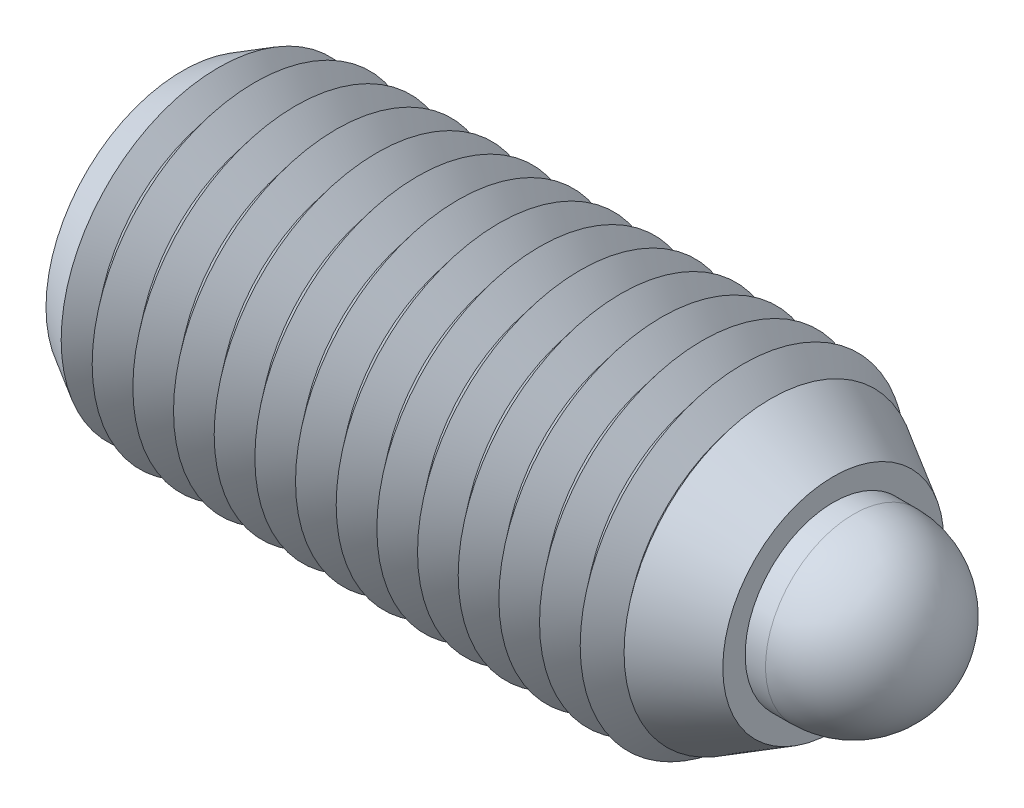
ISO-10303-21;
HEADER;
FILE_DESCRIPTION(('STEP AP214'),'2;1');
FILE_NAME('part.step','',(''),(''),'','','');
FILE_SCHEMA(('AUTOMOTIVE_DESIGN { 1 0 10303 214 1 1 1 1 }'));
ENDSEC;
DATA;
#1=APPLICATION_CONTEXT('core data for automotive mechanical design processes');
#2=APPLICATION_PROTOCOL_DEFINITION('international standard','automotive_design',2000,#1);
#3=PRODUCT_CONTEXT('',#1,'mechanical');
#4=PRODUCT('Part','Part','',(#3));
#5=PRODUCT_RELATED_PRODUCT_CATEGORY('part','',(#4));
#6=PRODUCT_DEFINITION_FORMATION('','',#4);
#7=PRODUCT_DEFINITION_CONTEXT('part definition',#1,'design');
#8=PRODUCT_DEFINITION('design','',#6,#7);
#9=PRODUCT_DEFINITION_SHAPE('','',#8);
#10=(LENGTH_UNIT() NAMED_UNIT(*) SI_UNIT(.MILLI.,.METRE.));
#11=(NAMED_UNIT(*) PLANE_ANGLE_UNIT() SI_UNIT($,.RADIAN.));
#12=(NAMED_UNIT(*) SI_UNIT($,.STERADIAN.) SOLID_ANGLE_UNIT());
#13=UNCERTAINTY_MEASURE_WITH_UNIT(LENGTH_MEASURE(1.E-05),#10,'distance_accuracy_value','');
#14=(GEOMETRIC_REPRESENTATION_CONTEXT(3) GLOBAL_UNCERTAINTY_ASSIGNED_CONTEXT((#13)) GLOBAL_UNIT_ASSIGNED_CONTEXT((#10,
#11,#12)) REPRESENTATION_CONTEXT('',''));
#15=CARTESIAN_POINT('',(0.,0.,0.));
#16=DIRECTION('',(0.,0.,1.));
#17=DIRECTION('',(1.,0.,0.));
#18=AXIS2_PLACEMENT_3D('',#15,#16,#17);
#19=CARTESIAN_POINT('',(44.2,0.,0.));
#20=DIRECTION('',(-1.,0.,0.));
#21=DIRECTION('',(0.,0.,1.));
#22=AXIS2_PLACEMENT_3D('',#19,#20,#21);
#23=CYLINDRICAL_SURFACE('',#22,9.1);
#24=CARTESIAN_POINT('',(36.5200000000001,0.,0.));
#25=DIRECTION('',(1.,0.,0.));
#26=DIRECTION('',(0.,0.,-1.));
#27=AXIS2_PLACEMENT_3D('',#24,#25,#26);
#28=CIRCLE('',#27,9.1);
#29=CARTESIAN_POINT('',(36.5200000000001,0.,-9.1));
#30=VERTEX_POINT('',#29);
#31=EDGE_CURVE('P0_E21',#30,#30,#28,.T.);
#32=ORIENTED_EDGE('',*,*,#31,.T.);
#33=EDGE_LOOP('',(#32));
#34=FACE_BOUND('',#33,.T.);
#35=CARTESIAN_POINT('',(41.6,0.,0.));
#36=DIRECTION('',(1.,0.,0.));
#37=DIRECTION('',(0.,0.,-1.));
#38=AXIS2_PLACEMENT_3D('',#35,#36,#37);
#39=CIRCLE('',#38,9.1);
#40=CARTESIAN_POINT('',(41.6,0.,-9.1));
#41=VERTEX_POINT('',#40);
#42=EDGE_CURVE('P0_E25',#41,#41,#39,.F.);
#43=ORIENTED_EDGE('',*,*,#42,.T.);
#44=EDGE_LOOP('',(#43));
#45=FACE_BOUND('',#44,.T.);
#46=ADVANCED_FACE('P0_F14',(#34,#45),#23,.T.);
#47=CARTESIAN_POINT('',(34.6,0.,0.));
#48=DIRECTION('',(1.,0.,0.));
#49=DIRECTION('',(0.,0.,-1.));
#50=AXIS2_PLACEMENT_3D('',#47,#48,#49);
#51=PLANE('',#50);
#52=CARTESIAN_POINT('',(34.6,0.,0.));
#53=DIRECTION('',(1.,0.,0.));
#54=DIRECTION('',(0.,0.,-1.));
#55=AXIS2_PLACEMENT_3D('',#52,#53,#54);
#56=CIRCLE('',#55,8.58553755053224);
#57=CARTESIAN_POINT('',(34.6,0.,-8.58553755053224));
#58=VERTEX_POINT('',#57);
#59=EDGE_CURVE('P0_E10',#58,#58,#56,.F.);
#60=ORIENTED_EDGE('',*,*,#59,.T.);
#61=EDGE_LOOP('',(#60));
#62=FACE_BOUND('',#61,.T.);
#63=ADVANCED_FACE('P0_F43',(#62),#51,.F.);
#64=CARTESIAN_POINT('',(49.5,0.,0.));
#65=DIRECTION('',(-1.,0.,0.));
#66=DIRECTION('',(0.,0.,1.));
#67=AXIS2_PLACEMENT_3D('',#64,#65,#66);
#68=CYLINDRICAL_SURFACE('',#67,6.5);
#69=CARTESIAN_POINT('',(49.5,0.,0.));
#70=DIRECTION('',(1.,0.,0.));
#71=DIRECTION('',(0.,0.,-1.));
#72=AXIS2_PLACEMENT_3D('',#69,#70,#71);
#73=CIRCLE('',#72,6.5);
#74=CARTESIAN_POINT('',(49.5,0.,-6.5));
#75=VERTEX_POINT('',#74);
#76=EDGE_CURVE('P0_E29',#75,#75,#73,.T.);
#77=ORIENTED_EDGE('',*,*,#76,.F.);
#78=EDGE_LOOP('',(#77));
#79=FACE_BOUND('',#78,.T.);
#80=CARTESIAN_POINT('',(44.2,0.,0.));
#81=DIRECTION('',(1.,0.,0.));
#82=DIRECTION('',(0.,0.,-1.));
#83=AXIS2_PLACEMENT_3D('',#80,#81,#82);
#84=CIRCLE('',#83,6.5);
#85=CARTESIAN_POINT('',(44.2,0.,-6.5));
#86=VERTEX_POINT('',#85);
#87=EDGE_CURVE('P0_E32',#86,#86,#84,.T.);
#88=ORIENTED_EDGE('',*,*,#87,.T.);
#89=EDGE_LOOP('',(#88));
#90=FACE_BOUND('',#89,.T.);
#91=ADVANCED_FACE('P0_F40',(#79,#90),#68,.T.);
#92=CARTESIAN_POINT('',(49.5,0.,0.));
#93=DIRECTION('',(-1.,0.,0.));
#94=DIRECTION('',(0.,1.,0.));
#95=AXIS2_PLACEMENT_3D('',#92,#93,#94);
#96=SPHERICAL_SURFACE('',#95,6.5);
#97=ORIENTED_EDGE('',*,*,#76,.T.);
#98=EDGE_LOOP('',(#97));
#99=FACE_BOUND('',#98,.T.);
#100=ADVANCED_FACE('P0_F38',(#99),#96,.T.);
#101=CARTESIAN_POINT('',(44.2,0.,0.));
#102=DIRECTION('',(-1.,0.,0.));
#103=DIRECTION('',(0.,0.,1.));
#104=AXIS2_PLACEMENT_3D('',#101,#102,#103);
#105=CONICAL_SURFACE('',#104,6.5,0.785398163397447);
#106=ORIENTED_EDGE('',*,*,#42,.F.);
#107=EDGE_LOOP('',(#106));
#108=FACE_BOUND('',#107,.T.);
#109=ORIENTED_EDGE('',*,*,#87,.F.);
#110=EDGE_LOOP('',(#109));
#111=FACE_BOUND('',#110,.T.);
#112=ADVANCED_FACE('P0_F47',(#108,#111),#105,.T.);
#113=CARTESIAN_POINT('',(36.5200000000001,0.,0.));
#114=DIRECTION('',(1.,0.,0.));
#115=DIRECTION('',(0.,0.,-1.));
#116=AXIS2_PLACEMENT_3D('',#113,#114,#115);
#117=CONICAL_SURFACE('',#116,9.1,0.261799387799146);
#118=ORIENTED_EDGE('',*,*,#59,.F.);
#119=EDGE_LOOP('',(#118));
#120=FACE_BOUND('',#119,.T.);
#121=ORIENTED_EDGE('',*,*,#31,.F.);
#122=EDGE_LOOP('',(#121));
#123=FACE_BOUND('',#122,.T.);
#124=ADVANCED_FACE('P0_F16',(#120,#123),#117,.T.);
#125=CLOSED_SHELL('',(#46,#63,#91,#100,#112,#124));
#126=MANIFOLD_SOLID_BREP('P0_B1',#125);
#127=CARTESIAN_POINT('',(48.,0.,0.));
#128=DIRECTION('',(-1.,0.,0.));
#129=DIRECTION('',(0.,0.,1.));
#130=AXIS2_PLACEMENT_3D('',#127,#128,#129);
#131=CONICAL_SURFACE('',#130,8.15,0.5235987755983);
#132=CARTESIAN_POINT('',(48.,0.,0.));
#133=DIRECTION('',(1.,0.,0.));
#134=DIRECTION('',(0.,0.,-1.));
#135=AXIS2_PLACEMENT_3D('',#132,#133,#134);
#136=CIRCLE('',#135,8.15);
#137=CARTESIAN_POINT('',(48.,0.,-8.15));
#138=VERTEX_POINT('',#137);
#139=EDGE_CURVE('P1_E326',#138,#138,#136,.T.);
#140=ORIENTED_EDGE('',*,*,#139,.F.);
#141=EDGE_LOOP('',(#140));
#142=FACE_BOUND('',#141,.T.);
#143=CARTESIAN_POINT('',(43.3832369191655,0.,0.));
#144=DIRECTION('',(1.,0.,0.));
#145=DIRECTION('',(0.,0.,-1.));
#146=AXIS2_PLACEMENT_3D('',#143,#144,#145);
#147=CIRCLE('',#146,10.8154894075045);
#148=CARTESIAN_POINT('',(43.3832369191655,0.,-10.8154894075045));
#149=VERTEX_POINT('',#148);
#150=EDGE_CURVE('P1_E330',#149,#149,#147,.T.);
#151=ORIENTED_EDGE('',*,*,#150,.T.);
#152=EDGE_LOOP('',(#151));
#153=FACE_BOUND('',#152,.T.);
#154=ADVANCED_FACE('P1_F15',(#142,#153),#131,.T.);
#155=CARTESIAN_POINT('',(48.,0.,0.));
#156=DIRECTION('',(1.,0.,0.));
#157=DIRECTION('',(0.,0.,-1.));
#158=AXIS2_PLACEMENT_3D('',#155,#156,#157);
#159=PLANE('',#158);
#160=ORIENTED_EDGE('',*,*,#139,.T.);
#161=EDGE_LOOP('',(#160));
#162=FACE_BOUND('',#161,.T.);
#163=CARTESIAN_POINT('',(48.,0.,0.));
#164=DIRECTION('',(1.,0.,0.));
#165=DIRECTION('',(0.,0.,-1.));
#166=AXIS2_PLACEMENT_3D('',#163,#164,#165);
#167=CIRCLE('',#166,6.5);
#168=CARTESIAN_POINT('',(48.,0.,-6.5));
#169=VERTEX_POINT('',#168);
#170=EDGE_CURVE('P1_E333',#169,#169,#167,.T.);
#171=ORIENTED_EDGE('',*,*,#170,.F.);
#172=EDGE_LOOP('',(#171));
#173=FACE_BOUND('',#172,.T.);
#174=ADVANCED_FACE('P1_F188',(#162,#173),#159,.T.);
#175=CARTESIAN_POINT('',(14.4,0.,0.));
#176=DIRECTION('',(-1.,0.,0.));
#177=DIRECTION('',(0.,0.,1.));
#178=AXIS2_PLACEMENT_3D('',#175,#176,#177);
#179=PLANE('',#178);
#180=CARTESIAN_POINT('',(14.4,0.,0.));
#181=DIRECTION('',(1.,0.,0.));
#182=DIRECTION('',(0.,0.,-1.));
#183=AXIS2_PLACEMENT_3D('',#180,#181,#182);
#184=CIRCLE('',#183,9.1);
#185=CARTESIAN_POINT('',(14.4,0.,-9.1));
#186=VERTEX_POINT('',#185);
#187=EDGE_CURVE('P1_E422',#186,#186,#184,.T.);
#188=ORIENTED_EDGE('',*,*,#187,.T.);
#189=EDGE_LOOP('',(#188));
#190=FACE_BOUND('',#189,.T.);
#191=ADVANCED_FACE('P1_F194',(#190),#179,.F.);
#192=CARTESIAN_POINT('',(48.,0.,0.));
#193=DIRECTION('',(1.,0.,0.));
#194=DIRECTION('',(0.,0.,-1.));
#195=AXIS2_PLACEMENT_3D('',#192,#193,#194);
#196=CYLINDRICAL_SURFACE('',#195,9.1);
#197=ORIENTED_EDGE('',*,*,#187,.F.);
#198=EDGE_LOOP('',(#197));
#199=FACE_BOUND('',#198,.T.);
#200=CARTESIAN_POINT('',(43.2,0.,0.));
#201=DIRECTION('',(1.,0.,0.));
#202=DIRECTION('',(0.,0.,-1.));
#203=AXIS2_PLACEMENT_3D('',#200,#201,#202);
#204=CIRCLE('',#203,9.09999999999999);
#205=CARTESIAN_POINT('',(43.2,0.,-9.1));
#206=VERTEX_POINT('',#205);
#207=EDGE_CURVE('P1_E420',#206,#206,#204,.T.);
#208=ORIENTED_EDGE('',*,*,#207,.T.);
#209=EDGE_LOOP('',(#208));
#210=FACE_BOUND('',#209,.T.);
#211=ADVANCED_FACE('P1_F461',(#199,#210),#196,.F.);
#212=CARTESIAN_POINT('',(48.,0.,0.));
#213=DIRECTION('',(-1.,0.,0.));
#214=DIRECTION('',(0.,0.,1.));
#215=AXIS2_PLACEMENT_3D('',#212,#213,#214);
#216=CONICAL_SURFACE('',#215,6.5,0.496422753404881);
#217=ORIENTED_EDGE('',*,*,#207,.F.);
#218=EDGE_LOOP('',(#217));
#219=FACE_BOUND('',#218,.T.);
#220=ORIENTED_EDGE('',*,*,#170,.T.);
#221=EDGE_LOOP('',(#220));
#222=FACE_BOUND('',#221,.T.);
#223=ADVANCED_FACE('P1_F467',(#219,#222),#216,.F.);
#224=CARTESIAN_POINT('',(42.8316043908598,0.,0.));
#225=DIRECTION('',(1.,0.,0.));
#226=DIRECTION('',(0.,0.,-1.));
#227=AXIS2_PLACEMENT_3D('',#224,#225,#226);
#228=CONICAL_SURFACE('',#227,10.1265006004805,0.895664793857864);
#229=ORIENTED_EDGE('',*,*,#150,.F.);
#230=EDGE_LOOP('',(#229));
#231=FACE_BOUND('',#230,.T.);
#232=CARTESIAN_POINT('',(42.8316043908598,0.,0.));
#233=DIRECTION('',(-1.,0.,0.));
#234=DIRECTION('',(0.,0.,1.));
#235=AXIS2_PLACEMENT_3D('',#232,#233,#234);
#236=CIRCLE('',#235,10.1265006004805);
#237=CARTESIAN_POINT('',(42.8316043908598,0.,10.1265006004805));
#238=VERTEX_POINT('',#237);
#239=EDGE_CURVE('P1_E334',#238,#238,#236,.T.);
#240=ORIENTED_EDGE('',*,*,#239,.F.);
#241=EDGE_LOOP('',(#240));
#242=FACE_BOUND('',#241,.T.);
#243=ADVANCED_FACE('P1_F474',(#231,#242),#228,.T.);
#244=CARTESIAN_POINT('',(41.3316043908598,0.,0.));
#245=DIRECTION('',(-1.,0.,0.));
#246=DIRECTION('',(0.,0.,1.));
#247=AXIS2_PLACEMENT_3D('',#244,#245,#246);
#248=CONICAL_SURFACE('',#247,12.,0.895664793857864);
#249=ORIENTED_EDGE('',*,*,#239,.T.);
#250=EDGE_LOOP('',(#249));
#251=FACE_BOUND('',#250,.T.);
#252=CARTESIAN_POINT('',(41.3316043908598,0.,0.));
#253=DIRECTION('',(-1.,0.,0.));
#254=DIRECTION('',(0.,0.,1.));
#255=AXIS2_PLACEMENT_3D('',#252,#253,#254);
#256=CIRCLE('',#255,12.);
#257=CARTESIAN_POINT('',(41.3316043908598,0.,12.));
#258=VERTEX_POINT('',#257);
#259=EDGE_CURVE('P1_E413',#258,#258,#256,.T.);
#260=ORIENTED_EDGE('',*,*,#259,.F.);
#261=EDGE_LOOP('',(#260));
#262=FACE_BOUND('',#261,.T.);
#263=ADVANCED_FACE('P1_F482',(#251,#262),#248,.T.);
#264=CARTESIAN_POINT('',(39.8316043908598,0.,0.));
#265=DIRECTION('',(1.,0.,0.));
#266=DIRECTION('',(0.,0.,-1.));
#267=AXIS2_PLACEMENT_3D('',#264,#265,#266);
#268=CONICAL_SURFACE('',#267,10.1265006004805,0.895664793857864);
#269=ORIENTED_EDGE('',*,*,#259,.T.);
#270=EDGE_LOOP('',(#269));
#271=FACE_BOUND('',#270,.T.);
#272=CARTESIAN_POINT('',(39.8316043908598,0.,0.));
#273=DIRECTION('',(-1.,0.,0.));
#274=DIRECTION('',(0.,0.,1.));
#275=AXIS2_PLACEMENT_3D('',#272,#273,#274);
#276=CIRCLE('',#275,10.1265006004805);
#277=CARTESIAN_POINT('',(39.8316043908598,0.,10.1265006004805));
#278=VERTEX_POINT('',#277);
#279=EDGE_CURVE('P1_E410',#278,#278,#276,.T.);
#280=ORIENTED_EDGE('',*,*,#279,.F.);
#281=EDGE_LOOP('',(#280));
#282=FACE_BOUND('',#281,.T.);
#283=ADVANCED_FACE('P1_F490',(#271,#282),#268,.T.);
#284=CARTESIAN_POINT('',(38.3316043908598,0.,0.));
#285=DIRECTION('',(-1.,0.,0.));
#286=DIRECTION('',(0.,0.,1.));
#287=AXIS2_PLACEMENT_3D('',#284,#285,#286);
#288=CONICAL_SURFACE('',#287,12.,0.895664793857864);
#289=ORIENTED_EDGE('',*,*,#279,.T.);
#290=EDGE_LOOP('',(#289));
#291=FACE_BOUND('',#290,.T.);
#292=CARTESIAN_POINT('',(38.3316043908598,0.,0.));
#293=DIRECTION('',(-1.,0.,0.));
#294=DIRECTION('',(0.,0.,1.));
#295=AXIS2_PLACEMENT_3D('',#292,#293,#294);
#296=CIRCLE('',#295,12.);
#297=CARTESIAN_POINT('',(38.3316043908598,0.,12.));
#298=VERTEX_POINT('',#297);
#299=EDGE_CURVE('P1_E407',#298,#298,#296,.T.);
#300=ORIENTED_EDGE('',*,*,#299,.F.);
#301=EDGE_LOOP('',(#300));
#302=FACE_BOUND('',#301,.T.);
#303=ADVANCED_FACE('P1_F498',(#291,#302),#288,.T.);
#304=CARTESIAN_POINT('',(36.8316043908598,0.,0.));
#305=DIRECTION('',(1.,0.,0.));
#306=DIRECTION('',(0.,0.,-1.));
#307=AXIS2_PLACEMENT_3D('',#304,#305,#306);
#308=CONICAL_SURFACE('',#307,10.1265006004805,0.895664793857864);
#309=ORIENTED_EDGE('',*,*,#299,.T.);
#310=EDGE_LOOP('',(#309));
#311=FACE_BOUND('',#310,.T.);
#312=CARTESIAN_POINT('',(36.8316043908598,0.,0.));
#313=DIRECTION('',(-1.,0.,0.));
#314=DIRECTION('',(0.,0.,1.));
#315=AXIS2_PLACEMENT_3D('',#312,#313,#314);
#316=CIRCLE('',#315,10.1265006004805);
#317=CARTESIAN_POINT('',(36.8316043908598,0.,10.1265006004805));
#318=VERTEX_POINT('',#317);
#319=EDGE_CURVE('P1_E404',#318,#318,#316,.T.);
#320=ORIENTED_EDGE('',*,*,#319,.F.);
#321=EDGE_LOOP('',(#320));
#322=FACE_BOUND('',#321,.T.);
#323=ADVANCED_FACE('P1_F506',(#311,#322),#308,.T.);
#324=CARTESIAN_POINT('',(35.3316043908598,0.,0.));
#325=DIRECTION('',(-1.,0.,0.));
#326=DIRECTION('',(0.,0.,1.));
#327=AXIS2_PLACEMENT_3D('',#324,#325,#326);
#328=CONICAL_SURFACE('',#327,12.,0.895664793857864);
#329=ORIENTED_EDGE('',*,*,#319,.T.);
#330=EDGE_LOOP('',(#329));
#331=FACE_BOUND('',#330,.T.);
#332=CARTESIAN_POINT('',(35.3316043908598,0.,0.));
#333=DIRECTION('',(-1.,0.,0.));
#334=DIRECTION('',(0.,0.,1.));
#335=AXIS2_PLACEMENT_3D('',#332,#333,#334);
#336=CIRCLE('',#335,12.);
#337=CARTESIAN_POINT('',(35.3316043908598,0.,12.));
#338=VERTEX_POINT('',#337);
#339=EDGE_CURVE('P1_E401',#338,#338,#336,.T.);
#340=ORIENTED_EDGE('',*,*,#339,.F.);
#341=EDGE_LOOP('',(#340));
#342=FACE_BOUND('',#341,.T.);
#343=ADVANCED_FACE('P1_F514',(#331,#342),#328,.T.);
#344=CARTESIAN_POINT('',(33.8316043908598,0.,0.));
#345=DIRECTION('',(1.,0.,0.));
#346=DIRECTION('',(0.,0.,-1.));
#347=AXIS2_PLACEMENT_3D('',#344,#345,#346);
#348=CONICAL_SURFACE('',#347,10.1265006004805,0.895664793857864);
#349=ORIENTED_EDGE('',*,*,#339,.T.);
#350=EDGE_LOOP('',(#349));
#351=FACE_BOUND('',#350,.T.);
#352=CARTESIAN_POINT('',(33.8316043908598,0.,0.));
#353=DIRECTION('',(-1.,0.,0.));
#354=DIRECTION('',(0.,0.,1.));
#355=AXIS2_PLACEMENT_3D('',#352,#353,#354);
#356=CIRCLE('',#355,10.1265006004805);
#357=CARTESIAN_POINT('',(33.8316043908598,0.,10.1265006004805));
#358=VERTEX_POINT('',#357);
#359=EDGE_CURVE('P1_E398',#358,#358,#356,.T.);
#360=ORIENTED_EDGE('',*,*,#359,.F.);
#361=EDGE_LOOP('',(#360));
#362=FACE_BOUND('',#361,.T.);
#363=ADVANCED_FACE('P1_F522',(#351,#362),#348,.T.);
#364=CARTESIAN_POINT('',(32.3316043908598,0.,0.));
#365=DIRECTION('',(-1.,0.,0.));
#366=DIRECTION('',(0.,0.,1.));
#367=AXIS2_PLACEMENT_3D('',#364,#365,#366);
#368=CONICAL_SURFACE('',#367,12.,0.895664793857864);
#369=ORIENTED_EDGE('',*,*,#359,.T.);
#370=EDGE_LOOP('',(#369));
#371=FACE_BOUND('',#370,.T.);
#372=CARTESIAN_POINT('',(32.3316043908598,0.,0.));
#373=DIRECTION('',(-1.,0.,0.));
#374=DIRECTION('',(0.,0.,1.));
#375=AXIS2_PLACEMENT_3D('',#372,#373,#374);
#376=CIRCLE('',#375,12.);
#377=CARTESIAN_POINT('',(32.3316043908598,0.,12.));
#378=VERTEX_POINT('',#377);
#379=EDGE_CURVE('P1_E395',#378,#378,#376,.T.);
#380=ORIENTED_EDGE('',*,*,#379,.F.);
#381=EDGE_LOOP('',(#380));
#382=FACE_BOUND('',#381,.T.);
#383=ADVANCED_FACE('P1_F530',(#371,#382),#368,.T.);
#384=CARTESIAN_POINT('',(30.8316043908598,0.,0.));
#385=DIRECTION('',(1.,0.,0.));
#386=DIRECTION('',(0.,0.,-1.));
#387=AXIS2_PLACEMENT_3D('',#384,#385,#386);
#388=CONICAL_SURFACE('',#387,10.1265006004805,0.895664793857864);
#389=ORIENTED_EDGE('',*,*,#379,.T.);
#390=EDGE_LOOP('',(#389));
#391=FACE_BOUND('',#390,.T.);
#392=CARTESIAN_POINT('',(30.8316043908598,0.,0.));
#393=DIRECTION('',(-1.,0.,0.));
#394=DIRECTION('',(0.,0.,1.));
#395=AXIS2_PLACEMENT_3D('',#392,#393,#394);
#396=CIRCLE('',#395,10.1265006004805);
#397=CARTESIAN_POINT('',(30.8316043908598,0.,10.1265006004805));
#398=VERTEX_POINT('',#397);
#399=EDGE_CURVE('P1_E392',#398,#398,#396,.T.);
#400=ORIENTED_EDGE('',*,*,#399,.F.);
#401=EDGE_LOOP('',(#400));
#402=FACE_BOUND('',#401,.T.);
#403=ADVANCED_FACE('P1_F538',(#391,#402),#388,.T.);
#404=CARTESIAN_POINT('',(29.3316043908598,0.,0.));
#405=DIRECTION('',(-1.,0.,0.));
#406=DIRECTION('',(0.,0.,1.));
#407=AXIS2_PLACEMENT_3D('',#404,#405,#406);
#408=CONICAL_SURFACE('',#407,12.,0.895664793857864);
#409=ORIENTED_EDGE('',*,*,#399,.T.);
#410=EDGE_LOOP('',(#409));
#411=FACE_BOUND('',#410,.T.);
#412=CARTESIAN_POINT('',(29.3316043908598,0.,0.));
#413=DIRECTION('',(-1.,0.,0.));
#414=DIRECTION('',(0.,0.,1.));
#415=AXIS2_PLACEMENT_3D('',#412,#413,#414);
#416=CIRCLE('',#415,12.);
#417=CARTESIAN_POINT('',(29.3316043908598,0.,12.));
#418=VERTEX_POINT('',#417);
#419=EDGE_CURVE('P1_E389',#418,#418,#416,.T.);
#420=ORIENTED_EDGE('',*,*,#419,.F.);
#421=EDGE_LOOP('',(#420));
#422=FACE_BOUND('',#421,.T.);
#423=ADVANCED_FACE('P1_F546',(#411,#422),#408,.T.);
#424=CARTESIAN_POINT('',(27.8316043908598,0.,0.));
#425=DIRECTION('',(1.,0.,0.));
#426=DIRECTION('',(0.,0.,-1.));
#427=AXIS2_PLACEMENT_3D('',#424,#425,#426);
#428=CONICAL_SURFACE('',#427,10.1265006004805,0.895664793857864);
#429=ORIENTED_EDGE('',*,*,#419,.T.);
#430=EDGE_LOOP('',(#429));
#431=FACE_BOUND('',#430,.T.);
#432=CARTESIAN_POINT('',(27.8316043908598,0.,0.));
#433=DIRECTION('',(-1.,0.,0.));
#434=DIRECTION('',(0.,0.,1.));
#435=AXIS2_PLACEMENT_3D('',#432,#433,#434);
#436=CIRCLE('',#435,10.1265006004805);
#437=CARTESIAN_POINT('',(27.8316043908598,0.,10.1265006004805));
#438=VERTEX_POINT('',#437);
#439=EDGE_CURVE('P1_E386',#438,#438,#436,.T.);
#440=ORIENTED_EDGE('',*,*,#439,.F.);
#441=EDGE_LOOP('',(#440));
#442=FACE_BOUND('',#441,.T.);
#443=ADVANCED_FACE('P1_F554',(#431,#442),#428,.T.);
#444=CARTESIAN_POINT('',(26.3316043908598,0.,0.));
#445=DIRECTION('',(-1.,0.,0.));
#446=DIRECTION('',(0.,0.,1.));
#447=AXIS2_PLACEMENT_3D('',#444,#445,#446);
#448=CONICAL_SURFACE('',#447,12.,0.895664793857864);
#449=ORIENTED_EDGE('',*,*,#439,.T.);
#450=EDGE_LOOP('',(#449));
#451=FACE_BOUND('',#450,.T.);
#452=CARTESIAN_POINT('',(26.3316043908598,0.,0.));
#453=DIRECTION('',(-1.,0.,0.));
#454=DIRECTION('',(0.,0.,1.));
#455=AXIS2_PLACEMENT_3D('',#452,#453,#454);
#456=CIRCLE('',#455,12.);
#457=CARTESIAN_POINT('',(26.3316043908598,0.,12.));
#458=VERTEX_POINT('',#457);
#459=EDGE_CURVE('P1_E383',#458,#458,#456,.T.);
#460=ORIENTED_EDGE('',*,*,#459,.F.);
#461=EDGE_LOOP('',(#460));
#462=FACE_BOUND('',#461,.T.);
#463=ADVANCED_FACE('P1_F562',(#451,#462),#448,.T.);
#464=CARTESIAN_POINT('',(24.8316043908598,0.,0.));
#465=DIRECTION('',(1.,0.,0.));
#466=DIRECTION('',(0.,0.,-1.));
#467=AXIS2_PLACEMENT_3D('',#464,#465,#466);
#468=CONICAL_SURFACE('',#467,10.1265006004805,0.895664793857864);
#469=ORIENTED_EDGE('',*,*,#459,.T.);
#470=EDGE_LOOP('',(#469));
#471=FACE_BOUND('',#470,.T.);
#472=CARTESIAN_POINT('',(24.8316043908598,0.,0.));
#473=DIRECTION('',(-1.,0.,0.));
#474=DIRECTION('',(0.,0.,1.));
#475=AXIS2_PLACEMENT_3D('',#472,#473,#474);
#476=CIRCLE('',#475,10.1265006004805);
#477=CARTESIAN_POINT('',(24.8316043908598,0.,10.1265006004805));
#478=VERTEX_POINT('',#477);
#479=EDGE_CURVE('P1_E380',#478,#478,#476,.T.);
#480=ORIENTED_EDGE('',*,*,#479,.F.);
#481=EDGE_LOOP('',(#480));
#482=FACE_BOUND('',#481,.T.);
#483=ADVANCED_FACE('P1_F570',(#471,#482),#468,.T.);
#484=CARTESIAN_POINT('',(23.3316043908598,0.,0.));
#485=DIRECTION('',(-1.,0.,0.));
#486=DIRECTION('',(0.,0.,1.));
#487=AXIS2_PLACEMENT_3D('',#484,#485,#486);
#488=CONICAL_SURFACE('',#487,12.,0.895664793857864);
#489=ORIENTED_EDGE('',*,*,#479,.T.);
#490=EDGE_LOOP('',(#489));
#491=FACE_BOUND('',#490,.T.);
#492=CARTESIAN_POINT('',(23.3316043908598,0.,0.));
#493=DIRECTION('',(-1.,0.,0.));
#494=DIRECTION('',(0.,0.,1.));
#495=AXIS2_PLACEMENT_3D('',#492,#493,#494);
#496=CIRCLE('',#495,12.);
#497=CARTESIAN_POINT('',(23.3316043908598,0.,12.));
#498=VERTEX_POINT('',#497);
#499=EDGE_CURVE('P1_E377',#498,#498,#496,.T.);
#500=ORIENTED_EDGE('',*,*,#499,.F.);
#501=EDGE_LOOP('',(#500));
#502=FACE_BOUND('',#501,.T.);
#503=ADVANCED_FACE('P1_F578',(#491,#502),#488,.T.);
#504=CARTESIAN_POINT('',(21.8316043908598,0.,0.));
#505=DIRECTION('',(1.,0.,0.));
#506=DIRECTION('',(0.,0.,-1.));
#507=AXIS2_PLACEMENT_3D('',#504,#505,#506);
#508=CONICAL_SURFACE('',#507,10.1265006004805,0.895664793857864);
#509=ORIENTED_EDGE('',*,*,#499,.T.);
#510=EDGE_LOOP('',(#509));
#511=FACE_BOUND('',#510,.T.);
#512=CARTESIAN_POINT('',(21.8316043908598,0.,0.));
#513=DIRECTION('',(-1.,0.,0.));
#514=DIRECTION('',(0.,0.,1.));
#515=AXIS2_PLACEMENT_3D('',#512,#513,#514);
#516=CIRCLE('',#515,10.1265006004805);
#517=CARTESIAN_POINT('',(21.8316043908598,0.,10.1265006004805));
#518=VERTEX_POINT('',#517);
#519=EDGE_CURVE('P1_E374',#518,#518,#516,.T.);
#520=ORIENTED_EDGE('',*,*,#519,.F.);
#521=EDGE_LOOP('',(#520));
#522=FACE_BOUND('',#521,.T.);
#523=ADVANCED_FACE('P1_F586',(#511,#522),#508,.T.);
#524=CARTESIAN_POINT('',(20.3316043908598,0.,0.));
#525=DIRECTION('',(-1.,0.,0.));
#526=DIRECTION('',(0.,0.,1.));
#527=AXIS2_PLACEMENT_3D('',#524,#525,#526);
#528=CONICAL_SURFACE('',#527,12.,0.895664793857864);
#529=ORIENTED_EDGE('',*,*,#519,.T.);
#530=EDGE_LOOP('',(#529));
#531=FACE_BOUND('',#530,.T.);
#532=CARTESIAN_POINT('',(20.3316043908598,0.,0.));
#533=DIRECTION('',(-1.,0.,0.));
#534=DIRECTION('',(0.,0.,1.));
#535=AXIS2_PLACEMENT_3D('',#532,#533,#534);
#536=CIRCLE('',#535,12.);
#537=CARTESIAN_POINT('',(20.3316043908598,0.,12.));
#538=VERTEX_POINT('',#537);
#539=EDGE_CURVE('P1_E371',#538,#538,#536,.T.);
#540=ORIENTED_EDGE('',*,*,#539,.F.);
#541=EDGE_LOOP('',(#540));
#542=FACE_BOUND('',#541,.T.);
#543=ADVANCED_FACE('P1_F594',(#531,#542),#528,.T.);
#544=CARTESIAN_POINT('',(18.8316043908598,0.,0.));
#545=DIRECTION('',(1.,0.,0.));
#546=DIRECTION('',(0.,0.,-1.));
#547=AXIS2_PLACEMENT_3D('',#544,#545,#546);
#548=CONICAL_SURFACE('',#547,10.1265006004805,0.895664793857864);
#549=ORIENTED_EDGE('',*,*,#539,.T.);
#550=EDGE_LOOP('',(#549));
#551=FACE_BOUND('',#550,.T.);
#552=CARTESIAN_POINT('',(18.8316043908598,0.,0.));
#553=DIRECTION('',(-1.,0.,0.));
#554=DIRECTION('',(0.,0.,1.));
#555=AXIS2_PLACEMENT_3D('',#552,#553,#554);
#556=CIRCLE('',#555,10.1265006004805);
#557=CARTESIAN_POINT('',(18.8316043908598,0.,10.1265006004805));
#558=VERTEX_POINT('',#557);
#559=EDGE_CURVE('P1_E368',#558,#558,#556,.T.);
#560=ORIENTED_EDGE('',*,*,#559,.F.);
#561=EDGE_LOOP('',(#560));
#562=FACE_BOUND('',#561,.T.);
#563=ADVANCED_FACE('P1_F602',(#551,#562),#548,.T.);
#564=CARTESIAN_POINT('',(17.3316043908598,0.,0.));
#565=DIRECTION('',(-1.,0.,0.));
#566=DIRECTION('',(0.,0.,1.));
#567=AXIS2_PLACEMENT_3D('',#564,#565,#566);
#568=CONICAL_SURFACE('',#567,12.,0.895664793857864);
#569=ORIENTED_EDGE('',*,*,#559,.T.);
#570=EDGE_LOOP('',(#569));
#571=FACE_BOUND('',#570,.T.);
#572=CARTESIAN_POINT('',(17.3316043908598,0.,0.));
#573=DIRECTION('',(-1.,0.,0.));
#574=DIRECTION('',(0.,0.,1.));
#575=AXIS2_PLACEMENT_3D('',#572,#573,#574);
#576=CIRCLE('',#575,12.);
#577=CARTESIAN_POINT('',(17.3316043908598,0.,12.));
#578=VERTEX_POINT('',#577);
#579=EDGE_CURVE('P1_E365',#578,#578,#576,.T.);
#580=ORIENTED_EDGE('',*,*,#579,.F.);
#581=EDGE_LOOP('',(#580));
#582=FACE_BOUND('',#581,.T.);
#583=ADVANCED_FACE('P1_F610',(#571,#582),#568,.T.);
#584=CARTESIAN_POINT('',(15.8316043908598,0.,0.));
#585=DIRECTION('',(1.,0.,0.));
#586=DIRECTION('',(0.,0.,-1.));
#587=AXIS2_PLACEMENT_3D('',#584,#585,#586);
#588=CONICAL_SURFACE('',#587,10.1265006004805,0.895664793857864);
#589=ORIENTED_EDGE('',*,*,#579,.T.);
#590=EDGE_LOOP('',(#589));
#591=FACE_BOUND('',#590,.T.);
#592=CARTESIAN_POINT('',(15.8316043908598,0.,0.));
#593=DIRECTION('',(-1.,0.,0.));
#594=DIRECTION('',(0.,0.,1.));
#595=AXIS2_PLACEMENT_3D('',#592,#593,#594);
#596=CIRCLE('',#595,10.1265006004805);
#597=CARTESIAN_POINT('',(15.8316043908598,0.,10.1265006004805));
#598=VERTEX_POINT('',#597);
#599=EDGE_CURVE('P1_E362',#598,#598,#596,.T.);
#600=ORIENTED_EDGE('',*,*,#599,.F.);
#601=EDGE_LOOP('',(#600));
#602=FACE_BOUND('',#601,.T.);
#603=ADVANCED_FACE('P1_F618',(#591,#602),#588,.T.);
#604=CARTESIAN_POINT('',(14.3316043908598,0.,0.));
#605=DIRECTION('',(-1.,0.,0.));
#606=DIRECTION('',(0.,0.,1.));
#607=AXIS2_PLACEMENT_3D('',#604,#605,#606);
#608=CONICAL_SURFACE('',#607,12.,0.895664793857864);
#609=ORIENTED_EDGE('',*,*,#599,.T.);
#610=EDGE_LOOP('',(#609));
#611=FACE_BOUND('',#610,.T.);
#612=CARTESIAN_POINT('',(14.3316043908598,0.,0.));
#613=DIRECTION('',(-1.,0.,0.));
#614=DIRECTION('',(0.,0.,1.));
#615=AXIS2_PLACEMENT_3D('',#612,#613,#614);
#616=CIRCLE('',#615,12.);
#617=CARTESIAN_POINT('',(14.3316043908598,0.,12.));
#618=VERTEX_POINT('',#617);
#619=EDGE_CURVE('P1_E359',#618,#618,#616,.T.);
#620=ORIENTED_EDGE('',*,*,#619,.F.);
#621=EDGE_LOOP('',(#620));
#622=FACE_BOUND('',#621,.T.);
#623=ADVANCED_FACE('P1_F626',(#611,#622),#608,.T.);
#624=CARTESIAN_POINT('',(12.8316043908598,0.,0.));
#625=DIRECTION('',(1.,0.,0.));
#626=DIRECTION('',(0.,0.,-1.));
#627=AXIS2_PLACEMENT_3D('',#624,#625,#626);
#628=CONICAL_SURFACE('',#627,10.1265006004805,0.895664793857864);
#629=ORIENTED_EDGE('',*,*,#619,.T.);
#630=EDGE_LOOP('',(#629));
#631=FACE_BOUND('',#630,.T.);
#632=CARTESIAN_POINT('',(12.8316043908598,0.,0.));
#633=DIRECTION('',(-1.,0.,0.));
#634=DIRECTION('',(0.,0.,1.));
#635=AXIS2_PLACEMENT_3D('',#632,#633,#634);
#636=CIRCLE('',#635,10.1265006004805);
#637=CARTESIAN_POINT('',(12.8316043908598,0.,10.1265006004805));
#638=VERTEX_POINT('',#637);
#639=EDGE_CURVE('P1_E356',#638,#638,#636,.T.);
#640=ORIENTED_EDGE('',*,*,#639,.F.);
#641=EDGE_LOOP('',(#640));
#642=FACE_BOUND('',#641,.T.);
#643=ADVANCED_FACE('P1_F634',(#631,#642),#628,.T.);
#644=CARTESIAN_POINT('',(11.3316043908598,0.,0.));
#645=DIRECTION('',(-1.,0.,0.));
#646=DIRECTION('',(0.,0.,1.));
#647=AXIS2_PLACEMENT_3D('',#644,#645,#646);
#648=CONICAL_SURFACE('',#647,12.,0.895664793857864);
#649=ORIENTED_EDGE('',*,*,#639,.T.);
#650=EDGE_LOOP('',(#649));
#651=FACE_BOUND('',#650,.T.);
#652=CARTESIAN_POINT('',(11.3316043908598,0.,0.));
#653=DIRECTION('',(-1.,0.,0.));
#654=DIRECTION('',(0.,0.,1.));
#655=AXIS2_PLACEMENT_3D('',#652,#653,#654);
#656=CIRCLE('',#655,12.);
#657=CARTESIAN_POINT('',(11.3316043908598,0.,12.));
#658=VERTEX_POINT('',#657);
#659=EDGE_CURVE('P1_E353',#658,#658,#656,.T.);
#660=ORIENTED_EDGE('',*,*,#659,.F.);
#661=EDGE_LOOP('',(#660));
#662=FACE_BOUND('',#661,.T.);
#663=ADVANCED_FACE('P1_F642',(#651,#662),#648,.T.);
#664=CARTESIAN_POINT('',(9.83160439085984,0.,0.));
#665=DIRECTION('',(1.,0.,0.));
#666=DIRECTION('',(0.,0.,-1.));
#667=AXIS2_PLACEMENT_3D('',#664,#665,#666);
#668=CONICAL_SURFACE('',#667,10.1265006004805,0.895664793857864);
#669=ORIENTED_EDGE('',*,*,#659,.T.);
#670=EDGE_LOOP('',(#669));
#671=FACE_BOUND('',#670,.T.);
#672=CARTESIAN_POINT('',(9.83160439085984,0.,0.));
#673=DIRECTION('',(-1.,0.,0.));
#674=DIRECTION('',(0.,0.,1.));
#675=AXIS2_PLACEMENT_3D('',#672,#673,#674);
#676=CIRCLE('',#675,10.1265006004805);
#677=CARTESIAN_POINT('',(9.83160439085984,0.,10.1265006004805));
#678=VERTEX_POINT('',#677);
#679=EDGE_CURVE('P1_E350',#678,#678,#676,.T.);
#680=ORIENTED_EDGE('',*,*,#679,.F.);
#681=EDGE_LOOP('',(#680));
#682=FACE_BOUND('',#681,.T.);
#683=ADVANCED_FACE('P1_F650',(#671,#682),#668,.T.);
#684=CARTESIAN_POINT('',(8.33160439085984,0.,0.));
#685=DIRECTION('',(-1.,0.,0.));
#686=DIRECTION('',(0.,0.,1.));
#687=AXIS2_PLACEMENT_3D('',#684,#685,#686);
#688=CONICAL_SURFACE('',#687,12.,0.895664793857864);
#689=ORIENTED_EDGE('',*,*,#679,.T.);
#690=EDGE_LOOP('',(#689));
#691=FACE_BOUND('',#690,.T.);
#692=CARTESIAN_POINT('',(8.33160439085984,0.,0.));
#693=DIRECTION('',(-1.,0.,0.));
#694=DIRECTION('',(0.,0.,1.));
#695=AXIS2_PLACEMENT_3D('',#692,#693,#694);
#696=CIRCLE('',#695,12.);
#697=CARTESIAN_POINT('',(8.33160439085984,0.,12.));
#698=VERTEX_POINT('',#697);
#699=EDGE_CURVE('P1_E342',#698,#698,#696,.T.);
#700=ORIENTED_EDGE('',*,*,#699,.F.);
#701=EDGE_LOOP('',(#700));
#702=FACE_BOUND('',#701,.T.);
#703=ADVANCED_FACE('P1_F658',(#691,#702),#688,.T.);
#704=CARTESIAN_POINT('',(6.83160439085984,0.,0.));
#705=DIRECTION('',(1.,0.,0.));
#706=DIRECTION('',(0.,0.,-1.));
#707=AXIS2_PLACEMENT_3D('',#704,#705,#706);
#708=CONICAL_SURFACE('',#707,10.1265006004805,0.895664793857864);
#709=ORIENTED_EDGE('',*,*,#699,.T.);
#710=EDGE_LOOP('',(#709));
#711=FACE_BOUND('',#710,.T.);
#712=CARTESIAN_POINT('',(6.83160439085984,0.,0.));
#713=DIRECTION('',(-1.,0.,0.));
#714=DIRECTION('',(0.,0.,1.));
#715=AXIS2_PLACEMENT_3D('',#712,#713,#714);
#716=CIRCLE('',#715,10.1265006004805);
#717=CARTESIAN_POINT('',(6.83160439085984,0.,10.1265006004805));
#718=VERTEX_POINT('',#717);
#719=EDGE_CURVE('P1_E338',#718,#718,#716,.T.);
#720=ORIENTED_EDGE('',*,*,#719,.F.);
#721=EDGE_LOOP('',(#720));
#722=FACE_BOUND('',#721,.T.);
#723=ADVANCED_FACE('P1_F666',(#711,#722),#708,.T.);
#724=CARTESIAN_POINT('',(5.33160439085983,0.,0.));
#725=DIRECTION('',(-1.,0.,0.));
#726=DIRECTION('',(0.,0.,1.));
#727=AXIS2_PLACEMENT_3D('',#724,#725,#726);
#728=CONICAL_SURFACE('',#727,12.,0.895664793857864);
#729=ORIENTED_EDGE('',*,*,#719,.T.);
#730=EDGE_LOOP('',(#729));
#731=FACE_BOUND('',#730,.T.);
#732=CARTESIAN_POINT('',(5.33160439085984,0.,0.));
#733=DIRECTION('',(-1.,0.,0.));
#734=DIRECTION('',(0.,0.,1.));
#735=AXIS2_PLACEMENT_3D('',#732,#733,#734);
#736=CIRCLE('',#735,12.);
#737=CARTESIAN_POINT('',(5.33160439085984,0.,12.));
#738=VERTEX_POINT('',#737);
#739=EDGE_CURVE('P1_E126',#738,#738,#736,.T.);
#740=ORIENTED_EDGE('',*,*,#739,.F.);
#741=EDGE_LOOP('',(#740));
#742=FACE_BOUND('',#741,.T.);
#743=ADVANCED_FACE('P1_F674',(#731,#742),#728,.T.);
#744=CARTESIAN_POINT('',(3.83160439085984,0.,0.));
#745=DIRECTION('',(1.,0.,0.));
#746=DIRECTION('',(0.,0.,-1.));
#747=AXIS2_PLACEMENT_3D('',#744,#745,#746);
#748=CONICAL_SURFACE('',#747,10.1265006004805,0.895664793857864);
#749=ORIENTED_EDGE('',*,*,#739,.T.);
#750=EDGE_LOOP('',(#749));
#751=FACE_BOUND('',#750,.T.);
#752=CARTESIAN_POINT('',(3.83160439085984,0.,0.));
#753=DIRECTION('',(-1.,0.,0.));
#754=DIRECTION('',(0.,0.,1.));
#755=AXIS2_PLACEMENT_3D('',#752,#753,#754);
#756=CIRCLE('',#755,10.1265006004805);
#757=CARTESIAN_POINT('',(3.83160439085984,0.,10.1265006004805));
#758=VERTEX_POINT('',#757);
#759=EDGE_CURVE('P1_E123',#758,#758,#756,.T.);
#760=ORIENTED_EDGE('',*,*,#759,.F.);
#761=EDGE_LOOP('',(#760));
#762=FACE_BOUND('',#761,.T.);
#763=ADVANCED_FACE('P1_F682',(#751,#762),#748,.T.);
#764=CARTESIAN_POINT('',(2.33160439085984,0.,0.));
#765=DIRECTION('',(-1.,0.,0.));
#766=DIRECTION('',(0.,0.,1.));
#767=AXIS2_PLACEMENT_3D('',#764,#765,#766);
#768=CONICAL_SURFACE('',#767,12.,0.895664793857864);
#769=CARTESIAN_POINT('',(2.64854671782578,0.,0.));
#770=DIRECTION('',(-1.,0.,0.));
#771=DIRECTION('',(0.,0.,1.));
#772=AXIS2_PLACEMENT_3D('',#769,#770,#771);
#773=CIRCLE('',#772,11.604139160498);
#774=CARTESIAN_POINT('',(2.64854671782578,0.,11.604139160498));
#775=VERTEX_POINT('',#774);
#776=EDGE_CURVE('P1_E336',#775,#775,#773,.T.);
#777=ORIENTED_EDGE('',*,*,#776,.F.);
#778=EDGE_LOOP('',(#777));
#779=FACE_BOUND('',#778,.T.);
#780=ORIENTED_EDGE('',*,*,#759,.T.);
#781=EDGE_LOOP('',(#780));
#782=FACE_BOUND('',#781,.T.);
#783=ADVANCED_FACE('P1_F145',(#779,#782),#768,.T.);
#784=CARTESIAN_POINT('',(0.,0.,0.));
#785=DIRECTION('',(1.,0.,0.));
#786=DIRECTION('',(0.,0.,-1.));
#787=AXIS2_PLACEMENT_3D('',#784,#785,#786);
#788=PLANE('',#787);
#789=CARTESIAN_POINT('',(0.,0.,0.));
#790=DIRECTION('',(1.,0.,0.));
#791=DIRECTION('',(0.,0.,-1.));
#792=AXIS2_PLACEMENT_3D('',#789,#790,#791);
#793=CIRCLE('',#792,10.075);
#794=CARTESIAN_POINT('',(0.,0.,-10.075));
#795=VERTEX_POINT('',#794);
#796=EDGE_CURVE('P1_E249',#795,#795,#793,.F.);
#797=ORIENTED_EDGE('',*,*,#796,.T.);
#798=EDGE_LOOP('',(#797));
#799=FACE_BOUND('',#798,.T.);
#800=CARTESIAN_POINT('',(0.,0.,0.));
#801=DIRECTION('',(1.,0.,0.));
#802=DIRECTION('',(0.,0.,-1.));
#803=AXIS2_PLACEMENT_3D('',#800,#801,#802);
#804=CIRCLE('',#803,6.92820323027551);
#805=CARTESIAN_POINT('',(0.,-3.46410161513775,-6.));
#806=VERTEX_POINT('',#805);
#807=CARTESIAN_POINT('',(0.,3.46410161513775,-6.));
#808=VERTEX_POINT('',#807);
#809=EDGE_CURVE('P1_E19',#806,#808,#804,.T.);
#810=ORIENTED_EDGE('',*,*,#809,.T.);
#811=CARTESIAN_POINT('',(0.,6.92820323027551,0.));
#812=VERTEX_POINT('',#811);
#813=EDGE_CURVE('P1_E10',#808,#812,#804,.T.);
#814=ORIENTED_EDGE('',*,*,#813,.T.);
#815=CARTESIAN_POINT('',(0.,0.,0.));
#816=DIRECTION('',(-1.,0.,0.));
#817=DIRECTION('',(0.,0.,1.));
#818=AXIS2_PLACEMENT_3D('',#815,#816,#817);
#819=CIRCLE('',#818,6.92820323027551);
#820=CARTESIAN_POINT('',(0.,3.46410161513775,6.));
#821=VERTEX_POINT('',#820);
#822=EDGE_CURVE('P1_E35',#821,#812,#819,.T.);
#823=ORIENTED_EDGE('',*,*,#822,.F.);
#824=CARTESIAN_POINT('',(0.,-3.46410161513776,6.));
#825=VERTEX_POINT('',#824);
#826=EDGE_CURVE('P1_E24',#821,#825,#804,.T.);
#827=ORIENTED_EDGE('',*,*,#826,.T.);
#828=CARTESIAN_POINT('',(0.,-6.92820323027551,0.));
#829=VERTEX_POINT('',#828);
#830=EDGE_CURVE('P1_E250',#825,#829,#804,.T.);
#831=ORIENTED_EDGE('',*,*,#830,.T.);
#832=EDGE_CURVE('P1_E245',#829,#806,#804,.T.);
#833=ORIENTED_EDGE('',*,*,#832,.T.);
#834=EDGE_LOOP('',(#810,#814,#823,#827,#831,#833));
#835=FACE_BOUND('',#834,.T.);
#836=ADVANCED_FACE('P1_F103',(#799,#835),#788,.F.);
#837=CARTESIAN_POINT('',(3.33419780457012,0.,0.));
#838=DIRECTION('',(1.,0.,0.));
#839=DIRECTION('',(0.,0.,-1.));
#840=AXIS2_PLACEMENT_3D('',#837,#838,#839);
#841=CONICAL_SURFACE('',#840,12.,0.523598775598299);
#842=ORIENTED_EDGE('',*,*,#796,.F.);
#843=EDGE_LOOP('',(#842));
#844=FACE_BOUND('',#843,.T.);
#845=ORIENTED_EDGE('',*,*,#776,.T.);
#846=EDGE_LOOP('',(#845));
#847=FACE_BOUND('',#846,.T.);
#848=ADVANCED_FACE('P1_F17',(#844,#847),#841,.T.);
#849=CARTESIAN_POINT('',(0.,0.,0.));
#850=DIRECTION('',(-1.,0.,0.));
#851=DIRECTION('',(0.,0.,1.));
#852=AXIS2_PLACEMENT_3D('',#849,#850,#851);
#853=CONICAL_SURFACE('',#852,6.92820323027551,1.0471975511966);
#854=ORIENTED_EDGE('',*,*,#809,.F.);
#855=CARTESIAN_POINT('',(-2.2310117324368,-8.97087072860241,-6.));
#856=CARTESIAN_POINT('',(-2.10670503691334,-8.71177006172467,-6.));
#857=CARTESIAN_POINT('',(-1.98368949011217,-8.4520381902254,-6.));
#858=CARTESIAN_POINT('',(-1.740973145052,-7.93097563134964,-6.));
#859=CARTESIAN_POINT('',(-1.62127294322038,-7.66964466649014,-6.));
#860=CARTESIAN_POINT('',(-1.38525102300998,-7.14354910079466,-6.));
#861=CARTESIAN_POINT('',(-1.26895420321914,-6.87877328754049,-6.));
#862=CARTESIAN_POINT('',(-1.04157560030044,-6.34699982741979,-6.));
#863=CARTESIAN_POINT('',(-0.930493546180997,-6.08000229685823,-6.));
#864=CARTESIAN_POINT('',(-0.712104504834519,-5.53632749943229,-6.));
#865=CARTESIAN_POINT('',(-0.604972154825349,-5.25957966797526,-6.));
#866=CARTESIAN_POINT('',(-0.399614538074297,-4.70273655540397,-6.));
#867=CARTESIAN_POINT('',(-0.30139030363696,-4.4226408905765,-6.));
#868=CARTESIAN_POINT('',(-0.116653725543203,-3.85929101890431,-6.));
#869=CARTESIAN_POINT('',(-0.0301147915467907,-3.57604562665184,-6.));
#870=CARTESIAN_POINT('',(0.128279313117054,-3.00552043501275,-6.));
#871=CARTESIAN_POINT('',(0.200139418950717,-2.7182420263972,-6.));
#872=CARTESIAN_POINT('',(0.325357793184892,-2.14021209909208,-6.));
#873=CARTESIAN_POINT('',(0.378753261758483,-1.84946879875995,-6.));
#874=CARTESIAN_POINT('',(0.463541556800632,-1.26472940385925,-6.));
#875=CARTESIAN_POINT('',(0.494935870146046,-0.970733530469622,-6.));
#876=CARTESIAN_POINT('',(0.532809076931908,-0.384639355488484,-6.));
#877=CARTESIAN_POINT('',(0.539581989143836,-0.0925605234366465,-6.));
#878=CARTESIAN_POINT('',(0.528394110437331,0.491140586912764,-6.));
#879=CARTESIAN_POINT('',(0.510431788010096,0.782762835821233,-6.));
#880=CARTESIAN_POINT('',(0.459121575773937,1.28773820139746,-6.));
#881=CARTESIAN_POINT('',(0.431014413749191,1.50164953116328,-6.));
#882=CARTESIAN_POINT('',(0.363425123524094,1.92768053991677,-6.));
#883=CARTESIAN_POINT('',(0.323941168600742,2.13979992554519,-6.));
#884=CARTESIAN_POINT('',(0.190524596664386,2.77330591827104,-6.));
#885=CARTESIAN_POINT('',(0.081658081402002,3.19157045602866,-6.));
#886=CARTESIAN_POINT('',(-0.104318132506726,3.81695106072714,-6.));
#887=CARTESIAN_POINT('',(-0.170947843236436,4.02736433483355,-6.));
#888=CARTESIAN_POINT('',(-0.310411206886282,4.44614462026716,-6.));
#889=CARTESIAN_POINT('',(-0.383244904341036,4.65451161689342,-6.));
#890=CARTESIAN_POINT('',(-0.534007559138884,5.06928263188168,-6.));
#891=CARTESIAN_POINT('',(-0.611934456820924,5.27568740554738,-6.));
#892=CARTESIAN_POINT('',(-0.772038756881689,5.68683328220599,-6.));
#893=CARTESIAN_POINT('',(-0.854216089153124,5.89157441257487,-6.));
#894=CARTESIAN_POINT('',(-1.06925048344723,6.41420124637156,-6.));
#895=CARTESIAN_POINT('',(-1.20464614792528,6.73104109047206,-6.));
#896=CARTESIAN_POINT('',(-1.48195051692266,7.36186651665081,-6.));
#897=CARTESIAN_POINT('',(-1.62385970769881,7.6758518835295,-6.));
#898=CARTESIAN_POINT('',(-1.91272706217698,8.30158542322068,-6.));
#899=CARTESIAN_POINT('',(-2.05968654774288,8.61333298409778,-6.));
#900=CARTESIAN_POINT('',(-2.35751660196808,9.23493870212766,-6.));
#901=CARTESIAN_POINT('',(-2.50838706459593,9.5447969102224,-6.));
#902=CARTESIAN_POINT('',(-2.81341403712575,10.1633525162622,-6.));
#903=CARTESIAN_POINT('',(-2.96757428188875,10.4720480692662,-6.));
#904=CARTESIAN_POINT('',(-3.27839937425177,11.088176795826,-6.));
#905=CARTESIAN_POINT('',(-3.43506424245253,11.3956099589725,-6.));
#906=CARTESIAN_POINT('',(-3.90804007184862,12.3162563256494,-6.));
#907=CARTESIAN_POINT('',(-4.22738020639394,12.9279128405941,-6.));
#908=CARTESIAN_POINT('',(-4.84116548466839,14.0907175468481,-6.));
#909=CARTESIAN_POINT('',(-5.13511566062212,14.6421281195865,-6.));
#910=CARTESIAN_POINT('',(-5.7263690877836,15.7431778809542,-6.));
#911=CARTESIAN_POINT('',(-6.02367248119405,16.2928169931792,-6.));
#912=CARTESIAN_POINT('',(-6.62002870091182,17.3893325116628,-6.));
#913=CARTESIAN_POINT('',(-6.91907515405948,17.936212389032,-6.));
#914=CARTESIAN_POINT('',(-7.51911281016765,19.0288635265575,-6.));
#915=CARTESIAN_POINT('',(-7.82010389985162,19.5746348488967,-6.));
#916=CARTESIAN_POINT('',(-8.12180895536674,20.1200088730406,-6.));
#917=B_SPLINE_CURVE_WITH_KNOTS('',3,(#855,#856,#857,#858,#859,#860,#861,#862,#863,#864,#865,
#866,#867,#868,#869,#870,#871,#872,#873,#874,#875,#876,#877,#878,#879,#880,#881,#882,#883,#884,
#885,#886,#887,#888,#889,#890,#891,#892,#893,#894,#895,#896,#897,#898,#899,#900,#901,#902,#903,
#904,#905,#906,#907,#908,#909,#910,#911,#912,#913,#914,#915,#916),.UNSPECIFIED.,.F.,.F.,(4,2,2,
2,2,2,2,2,2,2,2,2,2,2,2,2,2,2,2,2,2,2,2,2,2,2,2,2,2,2,4),(0.,0.862142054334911,1.7244382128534,
2.59196509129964,3.45944683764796,4.34960950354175,5.2398751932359,6.12807962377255,
7.01598493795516,7.90209084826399,8.78813686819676,9.66356667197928,10.539050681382,
11.1859809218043,11.8330150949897,13.1278948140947,13.7899805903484,14.4520711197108,
15.113895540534,15.7757090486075,16.8092741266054,17.8429164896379,18.8768314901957,
19.9107184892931,20.9458492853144,21.9809885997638,24.0509441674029,25.925536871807,
27.8002093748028,29.6701135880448,31.5399098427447),.UNSPECIFIED.);
#918=EDGE_CURVE('P1_E93',#808,#806,#917,.F.);
#919=ORIENTED_EDGE('',*,*,#918,.F.);
#920=EDGE_LOOP('',(#854,#919));
#921=FACE_BOUND('',#920,.T.);
#922=ADVANCED_FACE('P1_F248',(#921),#853,.F.);
#923=ORIENTED_EDGE('',*,*,#832,.F.);
#924=CARTESIAN_POINT('',(-6.66683333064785E-05,-3.46398614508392,-6.0002));
#925=CARTESIAN_POINT('',(0.0438893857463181,-3.54013114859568,-5.86831298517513));
#926=CARTESIAN_POINT('',(0.0858505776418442,-3.61656005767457,-5.73593423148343));
#927=CARTESIAN_POINT('',(0.165233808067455,-3.77003856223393,-5.47010166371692));
#928=CARTESIAN_POINT('',(0.202653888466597,-3.84708841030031,-5.33664741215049));
#929=CARTESIAN_POINT('',(0.307367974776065,-4.07947163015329,-4.93414786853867));
#930=CARTESIAN_POINT('',(0.366928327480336,-4.23572230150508,-4.66351376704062));
#931=CARTESIAN_POINT('',(0.436770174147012,-4.46954859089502,-4.25851475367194));
#932=CARTESIAN_POINT('',(0.456666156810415,-4.54642555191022,-4.12535995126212));
#933=CARTESIAN_POINT('',(0.490028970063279,-4.70052684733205,-3.85844867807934));
#934=CARTESIAN_POINT('',(0.503496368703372,-4.77775115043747,-3.72469226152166));
#935=CARTESIAN_POINT('',(0.523658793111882,-4.93233388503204,-3.45694711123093));
#936=CARTESIAN_POINT('',(0.530361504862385,-5.0096920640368,-3.32295881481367));
#937=CARTESIAN_POINT('',(0.536858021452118,-5.16447561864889,-3.05486583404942));
#938=CARTESIAN_POINT('',(0.536652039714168,-5.24190099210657,-2.92076115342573));
#939=CARTESIAN_POINT('',(0.526591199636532,-5.45402304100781,-2.55335498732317));
#940=CARTESIAN_POINT('',(0.509700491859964,-5.58865028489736,-2.3201737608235));
#941=CARTESIAN_POINT('',(0.456139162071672,-5.85701058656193,-1.85536008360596));
#942=CARTESIAN_POINT('',(0.419450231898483,-5.99074270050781,-1.6237292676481));
#943=CARTESIAN_POINT('',(0.327738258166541,-6.25964310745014,-1.15798010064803));
#944=CARTESIAN_POINT('',(0.272326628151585,-6.39477746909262,-0.923920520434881));
#945=CARTESIAN_POINT('',(0.146564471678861,-6.66303092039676,-0.459291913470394));
#946=CARTESIAN_POINT('',(0.076243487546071,-6.7961534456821,-0.228716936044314));
#947=CARTESIAN_POINT('',(-6.6668333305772E-05,-6.92831870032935,0.000199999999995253));
#948=B_SPLINE_CURVE_WITH_KNOTS('',3,(#924,#925,#926,#927,#928,#929,#930,#931,#932,#933,#934,
#935,#936,#937,#938,#939,#940,#941,#942,#943,#944,#945,#946,#947),.UNSPECIFIED.,.F.,.F.,(4,2,2,
2,2,2,2,2,2,2,2,4),(0.,0.475482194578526,0.951168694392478,1.90451835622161,2.36951738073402,
2.83447530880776,3.29890435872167,3.76331906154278,4.57182194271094,5.38107376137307,
6.20827406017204,7.03385036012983),.UNSPECIFIED.);
#949=EDGE_CURVE('P1_E163',#806,#829,#948,.T.);
#950=ORIENTED_EDGE('',*,*,#949,.F.);
#951=EDGE_LOOP('',(#923,#950));
#952=FACE_BOUND('',#951,.T.);
#953=ADVANCED_FACE('P1_F244',(#952),#853,.F.);
#954=ORIENTED_EDGE('',*,*,#830,.F.);
#955=CARTESIAN_POINT('',(-6.66683333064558E-05,-6.92831870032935,-0.000200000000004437));
#956=CARTESIAN_POINT('',(0.0438893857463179,-6.85217369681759,0.131687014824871));
#957=CARTESIAN_POINT('',(0.0858505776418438,-6.7757447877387,0.26406576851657));
#958=CARTESIAN_POINT('',(0.165233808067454,-6.62226628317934,0.529898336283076));
#959=CARTESIAN_POINT('',(0.202653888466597,-6.54521643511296,0.663352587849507));
#960=CARTESIAN_POINT('',(0.307367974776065,-6.31283321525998,1.06585213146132));
#961=CARTESIAN_POINT('',(0.366928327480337,-6.15658254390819,1.33648623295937));
#962=CARTESIAN_POINT('',(0.436770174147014,-5.92275625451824,1.74148524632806));
#963=CARTESIAN_POINT('',(0.456666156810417,-5.84587929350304,1.87464004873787));
#964=CARTESIAN_POINT('',(0.49002897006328,-5.69177799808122,2.14155132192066));
#965=CARTESIAN_POINT('',(0.503496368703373,-5.6145536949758,2.27530773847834));
#966=CARTESIAN_POINT('',(0.523658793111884,-5.45997096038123,2.54305288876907));
#967=CARTESIAN_POINT('',(0.530361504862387,-5.38261278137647,2.67704118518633));
#968=CARTESIAN_POINT('',(0.53685802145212,-5.22782922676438,2.94513416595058));
#969=CARTESIAN_POINT('',(0.536652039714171,-5.1504038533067,3.07923884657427));
#970=CARTESIAN_POINT('',(0.526591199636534,-4.93828180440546,3.44664501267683));
#971=CARTESIAN_POINT('',(0.509700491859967,-4.80365456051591,3.6798262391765));
#972=CARTESIAN_POINT('',(0.456139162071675,-4.53529425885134,4.14463991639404));
#973=CARTESIAN_POINT('',(0.419450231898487,-4.40156214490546,4.3762707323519));
#974=CARTESIAN_POINT('',(0.327738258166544,-4.13266173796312,4.84201989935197));
#975=CARTESIAN_POINT('',(0.272326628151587,-3.99752737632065,5.07607947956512));
#976=CARTESIAN_POINT('',(0.146564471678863,-3.7292739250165,5.54070808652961));
#977=CARTESIAN_POINT('',(0.0762434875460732,-3.59615139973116,5.77128306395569));
#978=CARTESIAN_POINT('',(-6.6668333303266E-05,-3.46398614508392,6.0002));
#979=B_SPLINE_CURVE_WITH_KNOTS('',3,(#955,#956,#957,#958,#959,#960,#961,#962,#963,#964,#965,
#966,#967,#968,#969,#970,#971,#972,#973,#974,#975,#976,#977,#978),.UNSPECIFIED.,.F.,.F.,(4,2,2,
2,2,2,2,2,2,2,2,4),(0.,0.475482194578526,0.951168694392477,1.90451835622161,2.36951738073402,
2.83447530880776,3.29890435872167,3.76331906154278,4.57182194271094,5.38107376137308,
6.20827406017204,7.03385036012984),.UNSPECIFIED.);
#980=EDGE_CURVE('P1_E156',#829,#825,#979,.T.);
#981=ORIENTED_EDGE('',*,*,#980,.F.);
#982=EDGE_LOOP('',(#954,#981));
#983=FACE_BOUND('',#982,.T.);
#984=ADVANCED_FACE('P1_F252',(#983),#853,.F.);
#985=ORIENTED_EDGE('',*,*,#826,.F.);
#986=CARTESIAN_POINT('',(-2.23101173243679,-8.9708707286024,6.));
#987=CARTESIAN_POINT('',(-2.10670503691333,-8.71177006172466,6.));
#988=CARTESIAN_POINT('',(-1.98368949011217,-8.45203819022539,6.));
#989=CARTESIAN_POINT('',(-1.74097314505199,-7.93097563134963,6.));
#990=CARTESIAN_POINT('',(-1.62127294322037,-7.66964466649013,6.));
#991=CARTESIAN_POINT('',(-1.38525102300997,-7.14354910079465,6.));
#992=CARTESIAN_POINT('',(-1.26895420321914,-6.87877328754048,6.));
#993=CARTESIAN_POINT('',(-1.04157560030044,-6.34699982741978,6.));
#994=CARTESIAN_POINT('',(-0.930493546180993,-6.08000229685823,6.));
#995=CARTESIAN_POINT('',(-0.712104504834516,-5.53632749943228,6.));
#996=CARTESIAN_POINT('',(-0.604972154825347,-5.25957966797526,6.));
#997=CARTESIAN_POINT('',(-0.399614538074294,-4.70273655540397,6.));
#998=CARTESIAN_POINT('',(-0.301390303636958,-4.4226408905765,6.));
#999=CARTESIAN_POINT('',(-0.116653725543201,-3.85929101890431,6.));
#1000=CARTESIAN_POINT('',(-0.0301147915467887,-3.57604562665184,6.));
#1001=CARTESIAN_POINT('',(0.128279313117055,-3.00552043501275,6.));
#1002=CARTESIAN_POINT('',(0.200139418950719,-2.7182420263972,6.));
#1003=CARTESIAN_POINT('',(0.325357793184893,-2.14021209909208,6.));
#1004=CARTESIAN_POINT('',(0.378753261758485,-1.84946879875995,6.));
#1005=CARTESIAN_POINT('',(0.463541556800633,-1.26472940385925,6.));
#1006=CARTESIAN_POINT('',(0.494935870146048,-0.970733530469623,6.));
#1007=CARTESIAN_POINT('',(0.532809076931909,-0.384639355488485,6.));
#1008=CARTESIAN_POINT('',(0.539581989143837,-0.0925605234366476,6.));
#1009=CARTESIAN_POINT('',(0.528394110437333,0.491140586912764,6.));
#1010=CARTESIAN_POINT('',(0.510431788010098,0.782762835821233,6.));
#1011=CARTESIAN_POINT('',(0.459121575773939,1.28773820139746,6.));
#1012=CARTESIAN_POINT('',(0.431014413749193,1.50164953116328,6.));
#1013=CARTESIAN_POINT('',(0.363425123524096,1.92768053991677,6.));
#1014=CARTESIAN_POINT('',(0.323941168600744,2.13979992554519,6.));
#1015=CARTESIAN_POINT('',(0.190524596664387,2.77330591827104,6.));
#1016=CARTESIAN_POINT('',(0.081658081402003,3.19157045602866,6.));
#1017=CARTESIAN_POINT('',(-0.104318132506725,3.81695106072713,6.));
#1018=CARTESIAN_POINT('',(-0.170947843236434,4.02736433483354,6.));
#1019=CARTESIAN_POINT('',(-0.31041120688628,4.44614462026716,6.));
#1020=CARTESIAN_POINT('',(-0.383244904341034,4.65451161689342,6.));
#1021=CARTESIAN_POINT('',(-0.534007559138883,5.06928263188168,6.));
#1022=CARTESIAN_POINT('',(-0.611934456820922,5.27568740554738,6.));
#1023=CARTESIAN_POINT('',(-0.772038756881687,5.68683328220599,6.));
#1024=CARTESIAN_POINT('',(-0.854216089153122,5.89157441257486,6.));
#1025=CARTESIAN_POINT('',(-1.06925048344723,6.41420124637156,6.));
#1026=CARTESIAN_POINT('',(-1.20464614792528,6.73104109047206,6.));
#1027=CARTESIAN_POINT('',(-1.48195051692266,7.36186651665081,6.));
#1028=CARTESIAN_POINT('',(-1.62385970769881,7.6758518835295,6.));
#1029=CARTESIAN_POINT('',(-1.91272706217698,8.30158542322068,6.));
#1030=CARTESIAN_POINT('',(-2.05968654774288,8.61333298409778,6.));
#1031=CARTESIAN_POINT('',(-2.35751660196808,9.23493870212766,6.));
#1032=CARTESIAN_POINT('',(-2.50838706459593,9.5447969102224,6.));
#1033=CARTESIAN_POINT('',(-2.81341403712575,10.1633525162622,6.));
#1034=CARTESIAN_POINT('',(-2.96757428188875,10.4720480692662,6.));
#1035=CARTESIAN_POINT('',(-3.27839937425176,11.088176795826,6.));
#1036=CARTESIAN_POINT('',(-3.43506424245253,11.3956099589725,6.));
#1037=CARTESIAN_POINT('',(-3.90804007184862,12.3162563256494,6.));
#1038=CARTESIAN_POINT('',(-4.22738020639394,12.9279128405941,6.));
#1039=CARTESIAN_POINT('',(-4.84116548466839,14.0907175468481,6.));
#1040=CARTESIAN_POINT('',(-5.13511566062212,14.6421281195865,6.));
#1041=CARTESIAN_POINT('',(-5.72636908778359,15.7431778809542,6.));
#1042=CARTESIAN_POINT('',(-6.02367248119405,16.2928169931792,6.));
#1043=CARTESIAN_POINT('',(-6.62002870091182,17.3893325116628,6.));
#1044=CARTESIAN_POINT('',(-6.91907515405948,17.936212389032,6.));
#1045=CARTESIAN_POINT('',(-7.51911281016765,19.0288635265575,6.));
#1046=CARTESIAN_POINT('',(-7.82010389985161,19.5746348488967,6.));
#1047=CARTESIAN_POINT('',(-8.12180895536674,20.1200088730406,6.));
#1048=B_SPLINE_CURVE_WITH_KNOTS('',3,(#986,#987,#988,#989,#990,#991,#992,#993,#994,#995,#996,
#997,#998,#999,#1000,#1001,#1002,#1003,#1004,#1005,#1006,#1007,#1008,#1009,#1010,#1011,#1012,
#1013,#1014,#1015,#1016,#1017,#1018,#1019,#1020,#1021,#1022,#1023,#1024,#1025,#1026,#1027,#1028,
#1029,#1030,#1031,#1032,#1033,#1034,#1035,#1036,#1037,#1038,#1039,#1040,#1041,#1042,#1043,#1044,
#1045,#1046,#1047),.UNSPECIFIED.,.F.,.F.,(4,2,2,2,2,2,2,2,2,2,2,2,2,2,2,2,2,2,2,2,2,2,2,2,2,2,2,
2,2,2,4),(0.,0.862142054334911,1.72443821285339,2.59196509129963,3.45944683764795,
4.34960950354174,5.23987519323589,6.12807962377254,7.01598493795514,7.90209084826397,
8.78813686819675,9.66356667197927,10.539050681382,11.1859809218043,11.8330150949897,
13.1278948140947,13.7899805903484,14.4520711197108,15.113895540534,15.7757090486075,
16.8092741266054,17.8429164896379,18.8768314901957,19.910718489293,20.9458492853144,
21.9809885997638,24.0509441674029,25.925536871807,27.8002093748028,29.6701135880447,
31.5399098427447),.UNSPECIFIED.);
#1049=EDGE_CURVE('P1_E100',#825,#821,#1048,.T.);
#1050=ORIENTED_EDGE('',*,*,#1049,.F.);
#1051=EDGE_LOOP('',(#985,#1050));
#1052=FACE_BOUND('',#1051,.T.);
#1053=ADVANCED_FACE('P1_F144',(#1052),#853,.F.);
#1054=ORIENTED_EDGE('',*,*,#822,.T.);
#1055=CARTESIAN_POINT('',(-6.66683333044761E-05,3.46398614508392,6.0002));
#1056=CARTESIAN_POINT('',(0.0438893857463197,3.54013114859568,5.86831298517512));
#1057=CARTESIAN_POINT('',(0.0858505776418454,3.61656005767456,5.73593423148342));
#1058=CARTESIAN_POINT('',(0.165233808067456,3.77003856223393,5.47010166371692));
#1059=CARTESIAN_POINT('',(0.202653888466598,3.8470884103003,5.33664741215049));
#1060=CARTESIAN_POINT('',(0.307367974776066,4.07947163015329,4.93414786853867));
#1061=CARTESIAN_POINT('',(0.366928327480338,4.23572230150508,4.66351376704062));
#1062=CARTESIAN_POINT('',(0.436770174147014,4.46954859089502,4.25851475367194));
#1063=CARTESIAN_POINT('',(0.456666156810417,4.54642555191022,4.12535995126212));
#1064=CARTESIAN_POINT('',(0.49002897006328,4.70052684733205,3.85844867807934));
#1065=CARTESIAN_POINT('',(0.503496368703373,4.77775115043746,3.72469226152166));
#1066=CARTESIAN_POINT('',(0.523658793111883,4.93233388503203,3.45694711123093));
#1067=CARTESIAN_POINT('',(0.530361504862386,5.0096920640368,3.32295881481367));
#1068=CARTESIAN_POINT('',(0.536858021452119,5.16447561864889,3.05486583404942));
#1069=CARTESIAN_POINT('',(0.53665203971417,5.24190099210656,2.92076115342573));
#1070=CARTESIAN_POINT('',(0.526591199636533,5.4540230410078,2.55335498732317));
#1071=CARTESIAN_POINT('',(0.509700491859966,5.58865028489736,2.3201737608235));
#1072=CARTESIAN_POINT('',(0.456139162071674,5.85701058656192,1.85536008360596));
#1073=CARTESIAN_POINT('',(0.419450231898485,5.99074270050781,1.6237292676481));
#1074=CARTESIAN_POINT('',(0.327738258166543,6.25964310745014,1.15798010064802));
#1075=CARTESIAN_POINT('',(0.272326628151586,6.39477746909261,0.923920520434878));
#1076=CARTESIAN_POINT('',(0.146564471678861,6.66303092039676,0.459291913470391));
#1077=CARTESIAN_POINT('',(0.0762434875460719,6.7961534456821,0.228716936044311));
#1078=CARTESIAN_POINT('',(-6.66683333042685E-05,6.92831870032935,-0.000199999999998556));
#1079=B_SPLINE_CURVE_WITH_KNOTS('',3,(#1055,#1056,#1057,#1058,#1059,#1060,#1061,#1062,#1063,
#1064,#1065,#1066,#1067,#1068,#1069,#1070,#1071,#1072,#1073,#1074,#1075,#1076,#1077,#1078),
.UNSPECIFIED.,.F.,.F.,(4,2,2,2,2,2,2,2,2,2,2,4),(0.,0.475482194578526,0.951168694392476,
1.90451835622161,2.36951738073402,2.83447530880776,3.29890435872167,3.76331906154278,
4.57182194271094,5.38107376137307,6.20827406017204,7.03385036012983),.UNSPECIFIED.);
#1080=EDGE_CURVE('P1_E92',#821,#812,#1079,.T.);
#1081=ORIENTED_EDGE('',*,*,#1080,.F.);
#1082=EDGE_LOOP('',(#1054,#1081));
#1083=FACE_BOUND('',#1082,.T.);
#1084=ADVANCED_FACE('P1_F97',(#1083),#853,.F.);
#1085=ORIENTED_EDGE('',*,*,#813,.F.);
#1086=CARTESIAN_POINT('',(-6.66683333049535E-05,6.92831870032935,0.000200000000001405));
#1087=CARTESIAN_POINT('',(0.0438893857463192,6.85217369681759,-0.131687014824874));
#1088=CARTESIAN_POINT('',(0.0858505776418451,6.7757447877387,-0.264065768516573));
#1089=CARTESIAN_POINT('',(0.165233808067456,6.62226628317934,-0.529898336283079));
#1090=CARTESIAN_POINT('',(0.202653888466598,6.54521643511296,-0.66335258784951));
#1091=CARTESIAN_POINT('',(0.307367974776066,6.31283321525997,-1.06585213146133));
#1092=CARTESIAN_POINT('',(0.366928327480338,6.15658254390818,-1.33648623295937));
#1093=CARTESIAN_POINT('',(0.436770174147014,5.92275625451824,-1.74148524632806));
#1094=CARTESIAN_POINT('',(0.456666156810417,5.84587929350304,-1.87464004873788));
#1095=CARTESIAN_POINT('',(0.49002897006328,5.69177799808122,-2.14155132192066));
#1096=CARTESIAN_POINT('',(0.503496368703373,5.6145536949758,-2.27530773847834));
#1097=CARTESIAN_POINT('',(0.523658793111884,5.45997096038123,-2.54305288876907));
#1098=CARTESIAN_POINT('',(0.530361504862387,5.38261278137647,-2.67704118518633));
#1099=CARTESIAN_POINT('',(0.53685802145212,5.22782922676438,-2.94513416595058));
#1100=CARTESIAN_POINT('',(0.53665203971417,5.1504038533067,-3.07923884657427));
#1101=CARTESIAN_POINT('',(0.526591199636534,4.93828180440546,-3.44664501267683));
#1102=CARTESIAN_POINT('',(0.509700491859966,4.80365456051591,-3.6798262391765));
#1103=CARTESIAN_POINT('',(0.456139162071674,4.53529425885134,-4.14463991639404));
#1104=CARTESIAN_POINT('',(0.419450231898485,4.40156214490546,-4.3762707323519));
#1105=CARTESIAN_POINT('',(0.327738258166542,4.13266173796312,-4.84201989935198));
#1106=CARTESIAN_POINT('',(0.272326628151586,3.99752737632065,-5.07607947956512));
#1107=CARTESIAN_POINT('',(0.146564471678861,3.7292739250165,-5.54070808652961));
#1108=CARTESIAN_POINT('',(0.0762434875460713,3.59615139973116,-5.77128306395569));
#1109=CARTESIAN_POINT('',(-6.66683333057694E-05,3.46398614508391,-6.0002));
#1110=B_SPLINE_CURVE_WITH_KNOTS('',3,(#1086,#1087,#1088,#1089,#1090,#1091,#1092,#1093,#1094,
#1095,#1096,#1097,#1098,#1099,#1100,#1101,#1102,#1103,#1104,#1105,#1106,#1107,#1108,#1109),
.UNSPECIFIED.,.F.,.F.,(4,2,2,2,2,2,2,2,2,2,2,4),(0.,0.475482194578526,0.951168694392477,
1.90451835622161,2.36951738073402,2.83447530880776,3.29890435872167,3.76331906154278,
4.57182194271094,5.38107376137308,6.20827406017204,7.03385036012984),.UNSPECIFIED.);
#1111=EDGE_CURVE('P1_E87',#812,#808,#1110,.T.);
#1112=ORIENTED_EDGE('',*,*,#1111,.F.);
#1113=EDGE_LOOP('',(#1085,#1112));
#1114=FACE_BOUND('',#1113,.T.);
#1115=ADVANCED_FACE('P1_F88',(#1114),#853,.F.);
#1116=CARTESIAN_POINT('',(8.64,0.,0.));
#1117=DIRECTION('',(-1.,0.,0.));
#1118=DIRECTION('',(0.,0.,1.));
#1119=AXIS2_PLACEMENT_3D('',#1116,#1117,#1118);
#1120=CONICAL_SURFACE('',#1119,6.,1.0471975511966);
#1121=CARTESIAN_POINT('',(12.1041016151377,0.,0.));
#1122=VERTEX_POINT('',#1121);
#1123=VERTEX_LOOP('',#1122);
#1124=FACE_BOUND('',#1123,.T.);
#1125=CARTESIAN_POINT('',(8.64,0.,0.));
#1126=DIRECTION('',(-1.,0.,0.));
#1127=DIRECTION('',(0.,0.,1.));
#1128=AXIS2_PLACEMENT_3D('',#1125,#1126,#1127);
#1129=CIRCLE('',#1128,6.);
#1130=CARTESIAN_POINT('',(8.64,0.,6.));
#1131=VERTEX_POINT('',#1130);
#1132=CARTESIAN_POINT('',(8.64,5.19615242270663,3.));
#1133=VERTEX_POINT('',#1132);
#1134=EDGE_CURVE('P1_E300',#1131,#1133,#1129,.T.);
#1135=ORIENTED_EDGE('',*,*,#1134,.T.);
#1136=CARTESIAN_POINT('',(8.64,5.19615242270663,-3.));
#1137=VERTEX_POINT('',#1136);
#1138=EDGE_CURVE('P1_E329',#1133,#1137,#1129,.T.);
#1139=ORIENTED_EDGE('',*,*,#1138,.T.);
#1140=CARTESIAN_POINT('',(8.64,0.,-6.00000000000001));
#1141=VERTEX_POINT('',#1140);
#1142=EDGE_CURVE('P1_E427',#1137,#1141,#1129,.T.);
#1143=ORIENTED_EDGE('',*,*,#1142,.T.);
#1144=CARTESIAN_POINT('',(8.64,-5.19615242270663,-3.00000000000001));
#1145=VERTEX_POINT('',#1144);
#1146=EDGE_CURVE('P1_E429',#1141,#1145,#1129,.T.);
#1147=ORIENTED_EDGE('',*,*,#1146,.T.);
#1148=CARTESIAN_POINT('',(8.64,-5.19615242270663,3.));
#1149=VERTEX_POINT('',#1148);
#1150=EDGE_CURVE('P1_E298',#1145,#1149,#1129,.T.);
#1151=ORIENTED_EDGE('',*,*,#1150,.T.);
#1152=EDGE_CURVE('P1_E295',#1149,#1131,#1129,.T.);
#1153=ORIENTED_EDGE('',*,*,#1152,.T.);
#1154=EDGE_LOOP('',(#1135,#1139,#1143,#1147,#1151,#1153));
#1155=FACE_BOUND('',#1154,.T.);
#1156=ADVANCED_FACE('P1_F269',(#1124,#1155),#1120,.F.);
#1157=CARTESIAN_POINT('',(8.64,-3.46410161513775,6.));
#1158=DIRECTION('',(-1.,0.,0.));
#1159=DIRECTION('',(0.,0.,1.));
#1160=AXIS2_PLACEMENT_3D('',#1157,#1158,#1159);
#1161=PLANE('',#1160);
#1162=ORIENTED_EDGE('',*,*,#1138,.F.);
#1163=DIRECTION('',(0.,0.5,-0.866025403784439));
#1164=VECTOR('',#1163,1.);
#1165=CARTESIAN_POINT('',(8.64,3.46410161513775,6.));
#1166=LINE('',#1165,#1164);
#1167=CARTESIAN_POINT('',(8.64,6.92820323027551,0.));
#1168=VERTEX_POINT('',#1167);
#1169=EDGE_CURVE('P1_E310',#1133,#1168,#1166,.T.);
#1170=ORIENTED_EDGE('',*,*,#1169,.T.);
#1171=DIRECTION('',(0.,-0.5,-0.866025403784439));
#1172=VECTOR('',#1171,1.);
#1173=CARTESIAN_POINT('',(8.64,6.92820323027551,0.));
#1174=LINE('',#1173,#1172);
#1175=EDGE_CURVE('P1_E113',#1168,#1137,#1174,.T.);
#1176=ORIENTED_EDGE('',*,*,#1175,.T.);
#1177=EDGE_LOOP('',(#1162,#1170,#1176));
#1178=FACE_BOUND('',#1177,.T.);
#1179=ADVANCED_FACE('P1_F217',(#1178),#1161,.T.);
#1180=ORIENTED_EDGE('',*,*,#1142,.F.);
#1181=CARTESIAN_POINT('',(8.64,3.46410161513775,-6.));
#1182=VERTEX_POINT('',#1181);
#1183=EDGE_CURVE('P1_E314',#1137,#1182,#1174,.T.);
#1184=ORIENTED_EDGE('',*,*,#1183,.T.);
#1185=DIRECTION('',(0.,-1.,0.));
#1186=VECTOR('',#1185,1.);
#1187=CARTESIAN_POINT('',(8.64,3.46410161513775,-6.));
#1188=LINE('',#1187,#1186);
#1189=EDGE_CURVE('P1_E317',#1182,#1141,#1188,.T.);
#1190=ORIENTED_EDGE('',*,*,#1189,.T.);
#1191=EDGE_LOOP('',(#1180,#1184,#1190));
#1192=FACE_BOUND('',#1191,.T.);
#1193=ADVANCED_FACE('P1_F280',(#1192),#1161,.T.);
#1194=ORIENTED_EDGE('',*,*,#1146,.F.);
#1195=CARTESIAN_POINT('',(8.64,-3.46410161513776,-6.));
#1196=VERTEX_POINT('',#1195);
#1197=EDGE_CURVE('P1_E316',#1141,#1196,#1188,.T.);
#1198=ORIENTED_EDGE('',*,*,#1197,.T.);
#1199=DIRECTION('',(0.,-0.5,0.866025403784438));
#1200=VECTOR('',#1199,1.);
#1201=CARTESIAN_POINT('',(8.64,-3.46410161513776,-6.));
#1202=LINE('',#1201,#1200);
#1203=EDGE_CURVE('P1_E227',#1196,#1145,#1202,.T.);
#1204=ORIENTED_EDGE('',*,*,#1203,.T.);
#1205=EDGE_LOOP('',(#1194,#1198,#1204));
#1206=FACE_BOUND('',#1205,.T.);
#1207=ADVANCED_FACE('P1_F292',(#1206),#1161,.T.);
#1208=ORIENTED_EDGE('',*,*,#1150,.F.);
#1209=CARTESIAN_POINT('',(8.64,-6.92820323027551,0.));
#1210=VERTEX_POINT('',#1209);
#1211=EDGE_CURVE('P1_E305',#1145,#1210,#1202,.T.);
#1212=ORIENTED_EDGE('',*,*,#1211,.T.);
#1213=DIRECTION('',(0.,0.5,0.866025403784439));
#1214=VECTOR('',#1213,1.);
#1215=CARTESIAN_POINT('',(8.64,-6.92820323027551,0.));
#1216=LINE('',#1215,#1214);
#1217=EDGE_CURVE('P1_E302',#1210,#1149,#1216,.T.);
#1218=ORIENTED_EDGE('',*,*,#1217,.T.);
#1219=EDGE_LOOP('',(#1208,#1212,#1218));
#1220=FACE_BOUND('',#1219,.T.);
#1221=ADVANCED_FACE('P1_F286',(#1220),#1161,.T.);
#1222=ORIENTED_EDGE('',*,*,#1152,.F.);
#1223=CARTESIAN_POINT('',(8.64,-3.46410161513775,6.));
#1224=VERTEX_POINT('',#1223);
#1225=EDGE_CURVE('P1_E296',#1149,#1224,#1216,.T.);
#1226=ORIENTED_EDGE('',*,*,#1225,.T.);
#1227=DIRECTION('',(0.,1.,0.));
#1228=VECTOR('',#1227,1.);
#1229=CARTESIAN_POINT('',(8.64,-3.46410161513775,6.));
#1230=LINE('',#1229,#1228);
#1231=EDGE_CURVE('P1_E225',#1224,#1131,#1230,.T.);
#1232=ORIENTED_EDGE('',*,*,#1231,.T.);
#1233=EDGE_LOOP('',(#1222,#1226,#1232));
#1234=FACE_BOUND('',#1233,.T.);
#1235=ADVANCED_FACE('P1_F215',(#1234),#1161,.T.);
#1236=ORIENTED_EDGE('',*,*,#1134,.F.);
#1237=CARTESIAN_POINT('',(8.64,3.46410161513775,6.));
#1238=VERTEX_POINT('',#1237);
#1239=EDGE_CURVE('P1_E306',#1131,#1238,#1230,.T.);
#1240=ORIENTED_EDGE('',*,*,#1239,.T.);
#1241=EDGE_CURVE('P1_E311',#1238,#1133,#1166,.T.);
#1242=ORIENTED_EDGE('',*,*,#1241,.T.);
#1243=EDGE_LOOP('',(#1236,#1240,#1242));
#1244=FACE_BOUND('',#1243,.T.);
#1245=ADVANCED_FACE('P1_F209',(#1244),#1161,.T.);
#1246=CARTESIAN_POINT('',(8.64,-3.46410161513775,6.));
#1247=DIRECTION('',(0.,0.,1.));
#1248=DIRECTION('',(0.,-1.,0.));
#1249=AXIS2_PLACEMENT_3D('',#1246,#1247,#1248);
#1250=PLANE('',#1249);
#1251=DIRECTION('',(-1.,0.,0.));
#1252=VECTOR('',#1251,1.);
#1253=CARTESIAN_POINT('',(8.64,-3.46410161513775,6.));
#1254=LINE('',#1253,#1252);
#1255=EDGE_CURVE('P1_E221',#1224,#825,#1254,.T.);
#1256=ORIENTED_EDGE('',*,*,#1255,.T.);
#1257=ORIENTED_EDGE('',*,*,#1049,.T.);
#1258=DIRECTION('',(-1.,0.,0.));
#1259=VECTOR('',#1258,1.);
#1260=CARTESIAN_POINT('',(8.64,3.46410161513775,6.));
#1261=LINE('',#1260,#1259);
#1262=EDGE_CURVE('P1_E117',#1238,#821,#1261,.T.);
#1263=ORIENTED_EDGE('',*,*,#1262,.F.);
#1264=ORIENTED_EDGE('',*,*,#1239,.F.);
#1265=ORIENTED_EDGE('',*,*,#1231,.F.);
#1266=EDGE_LOOP('',(#1256,#1257,#1263,#1264,#1265));
#1267=FACE_BOUND('',#1266,.T.);
#1268=ADVANCED_FACE('P1_F205',(#1267),#1250,.F.);
#1269=CARTESIAN_POINT('',(8.64,-6.92820323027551,0.));
#1270=DIRECTION('',(0.,-0.866025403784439,0.5));
#1271=DIRECTION('',(0.,-0.5,-0.866025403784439));
#1272=AXIS2_PLACEMENT_3D('',#1269,#1270,#1271);
#1273=PLANE('',#1272);
#1274=DIRECTION('',(-1.,0.,0.));
#1275=VECTOR('',#1274,1.);
#1276=CARTESIAN_POINT('',(8.64,-6.92820323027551,0.));
#1277=LINE('',#1276,#1275);
#1278=EDGE_CURVE('P1_E232',#1210,#829,#1277,.T.);
#1279=ORIENTED_EDGE('',*,*,#1278,.T.);
#1280=ORIENTED_EDGE('',*,*,#980,.T.);
#1281=ORIENTED_EDGE('',*,*,#1255,.F.);
#1282=ORIENTED_EDGE('',*,*,#1225,.F.);
#1283=ORIENTED_EDGE('',*,*,#1217,.F.);
#1284=EDGE_LOOP('',(#1279,#1280,#1281,#1282,#1283));
#1285=FACE_BOUND('',#1284,.T.);
#1286=ADVANCED_FACE('P1_F202',(#1285),#1273,.F.);
#1287=CARTESIAN_POINT('',(8.64,-3.46410161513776,-6.));
#1288=DIRECTION('',(0.,-0.866025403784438,-0.5));
#1289=DIRECTION('',(0.,0.5,-0.866025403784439));
#1290=AXIS2_PLACEMENT_3D('',#1287,#1288,#1289);
#1291=PLANE('',#1290);
#1292=DIRECTION('',(-1.,0.,0.));
#1293=VECTOR('',#1292,1.);
#1294=CARTESIAN_POINT('',(8.64,-3.46410161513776,-6.));
#1295=LINE('',#1294,#1293);
#1296=EDGE_CURVE('P1_E242',#1196,#806,#1295,.T.);
#1297=ORIENTED_EDGE('',*,*,#1296,.T.);
#1298=ORIENTED_EDGE('',*,*,#949,.T.);
#1299=ORIENTED_EDGE('',*,*,#1278,.F.);
#1300=ORIENTED_EDGE('',*,*,#1211,.F.);
#1301=ORIENTED_EDGE('',*,*,#1203,.F.);
#1302=EDGE_LOOP('',(#1297,#1298,#1299,#1300,#1301));
#1303=FACE_BOUND('',#1302,.T.);
#1304=ADVANCED_FACE('P1_F176',(#1303),#1291,.F.);
#1305=CARTESIAN_POINT('',(8.64,3.46410161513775,-6.));
#1306=DIRECTION('',(0.,0.,-1.));
#1307=DIRECTION('',(-1.,0.,0.));
#1308=AXIS2_PLACEMENT_3D('',#1305,#1306,#1307);
#1309=PLANE('',#1308);
#1310=DIRECTION('',(-1.,0.,0.));
#1311=VECTOR('',#1310,1.);
#1312=CARTESIAN_POINT('',(8.64,3.46410161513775,-6.));
#1313=LINE('',#1312,#1311);
#1314=EDGE_CURVE('P1_E116',#1182,#808,#1313,.T.);
#1315=ORIENTED_EDGE('',*,*,#1314,.T.);
#1316=ORIENTED_EDGE('',*,*,#918,.T.);
#1317=ORIENTED_EDGE('',*,*,#1296,.F.);
#1318=ORIENTED_EDGE('',*,*,#1197,.F.);
#1319=ORIENTED_EDGE('',*,*,#1189,.F.);
#1320=EDGE_LOOP('',(#1315,#1316,#1317,#1318,#1319));
#1321=FACE_BOUND('',#1320,.T.);
#1322=ADVANCED_FACE('P1_F173',(#1321),#1309,.F.);
#1323=CARTESIAN_POINT('',(8.64,6.92820323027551,0.));
#1324=DIRECTION('',(0.,0.866025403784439,-0.5));
#1325=DIRECTION('',(0.,0.5,0.866025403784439));
#1326=AXIS2_PLACEMENT_3D('',#1323,#1324,#1325);
#1327=PLANE('',#1326);
#1328=DIRECTION('',(-1.,0.,0.));
#1329=VECTOR('',#1328,1.);
#1330=CARTESIAN_POINT('',(8.64,6.92820323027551,0.));
#1331=LINE('',#1330,#1329);
#1332=EDGE_CURVE('P1_E109',#1168,#812,#1331,.T.);
#1333=ORIENTED_EDGE('',*,*,#1332,.T.);
#1334=ORIENTED_EDGE('',*,*,#1111,.T.);
#1335=ORIENTED_EDGE('',*,*,#1314,.F.);
#1336=ORIENTED_EDGE('',*,*,#1183,.F.);
#1337=ORIENTED_EDGE('',*,*,#1175,.F.);
#1338=EDGE_LOOP('',(#1333,#1334,#1335,#1336,#1337));
#1339=FACE_BOUND('',#1338,.T.);
#1340=ADVANCED_FACE('P1_F110',(#1339),#1327,.F.);
#1341=CARTESIAN_POINT('',(8.64,3.46410161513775,6.));
#1342=DIRECTION('',(0.,0.866025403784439,0.5));
#1343=DIRECTION('',(0.,-0.5,0.866025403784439));
#1344=AXIS2_PLACEMENT_3D('',#1341,#1342,#1343);
#1345=PLANE('',#1344);
#1346=ORIENTED_EDGE('',*,*,#1262,.T.);
#1347=ORIENTED_EDGE('',*,*,#1080,.T.);
#1348=ORIENTED_EDGE('',*,*,#1332,.F.);
#1349=ORIENTED_EDGE('',*,*,#1169,.F.);
#1350=ORIENTED_EDGE('',*,*,#1241,.F.);
#1351=EDGE_LOOP('',(#1346,#1347,#1348,#1349,#1350));
#1352=FACE_BOUND('',#1351,.T.);
#1353=ADVANCED_FACE('P1_F119',(#1352),#1345,.F.);
#1354=CLOSED_SHELL('',(#154,#174,#191,#211,#223,#243,#263,#283,#303,#323,#343,#363,#383,#403,
#423,#443,#463,#483,#503,#523,#543,#563,#583,#603,#623,#643,#663,#683,#703,#723,#743,#763,#783,
#836,#848,#922,#953,#984,#1053,#1084,#1115,#1156,#1179,#1193,#1207,#1221,#1235,#1245,#1268,
#1286,#1304,#1322,#1340,#1353));
#1355=MANIFOLD_SOLID_BREP('P1_B1',#1354);
#1356=ADVANCED_BREP_SHAPE_REPRESENTATION('',(#18,#126,#1355),#14);
#1357=SHAPE_DEFINITION_REPRESENTATION(#9,#1356);
ENDSEC;
END-ISO-10303-21;
